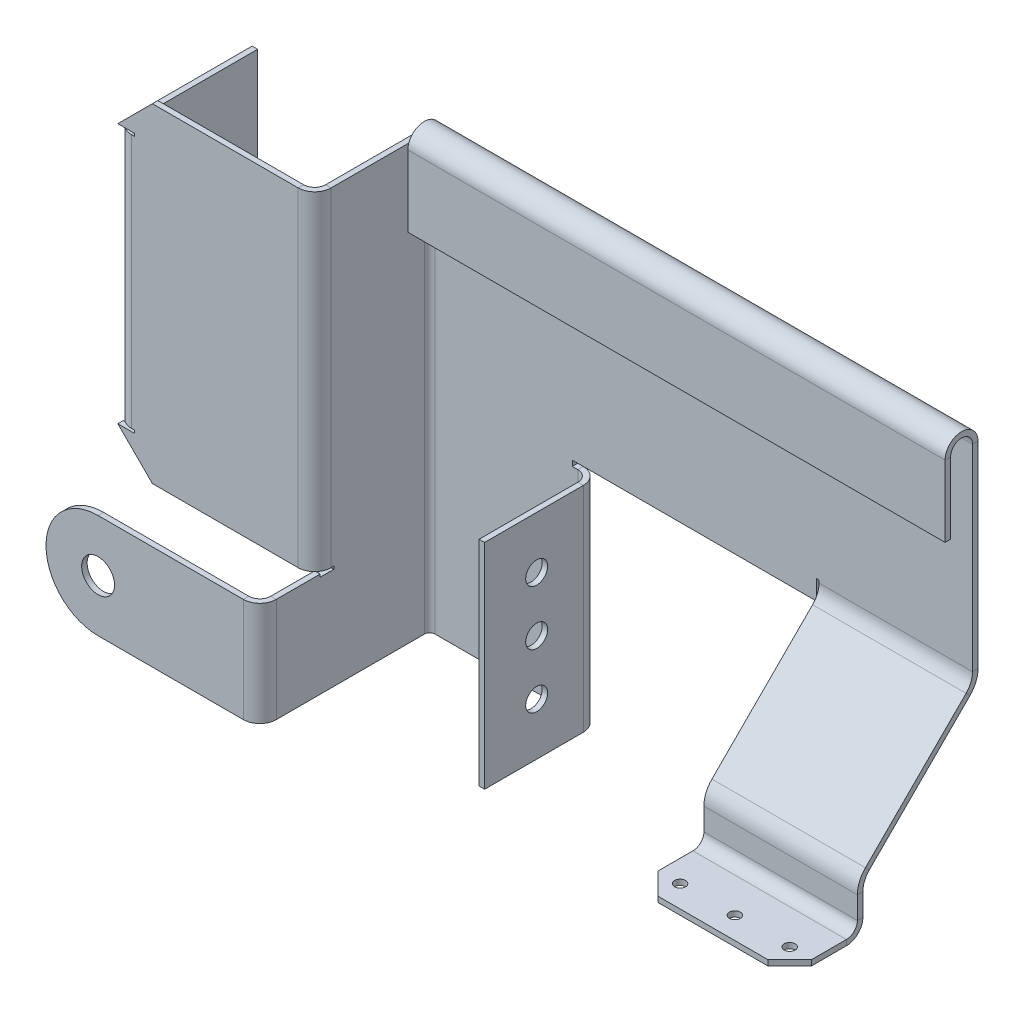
ISO-10303-21;
HEADER;
FILE_DESCRIPTION(('STEP AP214'),'2;1');
FILE_NAME('part.step','',(''),(''),'','','');
FILE_SCHEMA(('AUTOMOTIVE_DESIGN { 1 0 10303 214 1 1 1 1 }'));
ENDSEC;
DATA;
#1=APPLICATION_CONTEXT('core data for automotive mechanical design processes');
#2=APPLICATION_PROTOCOL_DEFINITION('international standard','automotive_design',2000,#1);
#3=PRODUCT_CONTEXT('',#1,'mechanical');
#4=PRODUCT('Part','Part','',(#3));
#5=PRODUCT_RELATED_PRODUCT_CATEGORY('part','',(#4));
#6=PRODUCT_DEFINITION_FORMATION('','',#4);
#7=PRODUCT_DEFINITION_CONTEXT('part definition',#1,'design');
#8=PRODUCT_DEFINITION('design','',#6,#7);
#9=PRODUCT_DEFINITION_SHAPE('','',#8);
#10=(LENGTH_UNIT() NAMED_UNIT(*) SI_UNIT(.MILLI.,.METRE.));
#11=(NAMED_UNIT(*) PLANE_ANGLE_UNIT() SI_UNIT($,.RADIAN.));
#12=(NAMED_UNIT(*) SI_UNIT($,.STERADIAN.) SOLID_ANGLE_UNIT());
#13=UNCERTAINTY_MEASURE_WITH_UNIT(LENGTH_MEASURE(1.E-05),#10,'distance_accuracy_value','');
#14=(GEOMETRIC_REPRESENTATION_CONTEXT(3) GLOBAL_UNCERTAINTY_ASSIGNED_CONTEXT((#13)) GLOBAL_UNIT_ASSIGNED_CONTEXT((#10,
#11,#12)) REPRESENTATION_CONTEXT('',''));
#15=CARTESIAN_POINT('',(0.,0.,0.));
#16=DIRECTION('',(0.,0.,1.));
#17=DIRECTION('',(1.,0.,0.));
#18=AXIS2_PLACEMENT_3D('',#15,#16,#17);
#19=CARTESIAN_POINT('',(0.,0.,2.5));
#20=DIRECTION('',(0.,1.,0.));
#21=DIRECTION('',(0.,0.,1.));
#22=AXIS2_PLACEMENT_3D('',#19,#20,#21);
#23=PLANE('',#22);
#24=DIRECTION('',(0.,0.,-1.));
#25=VECTOR('',#24,1.);
#26=CARTESIAN_POINT('',(-7.49999999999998,0.,2.5));
#27=LINE('',#26,#25);
#28=CARTESIAN_POINT('',(-7.49999999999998,0.,2.5));
#29=VERTEX_POINT('',#28);
#30=CARTESIAN_POINT('',(-7.49999999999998,0.,0.));
#31=VERTEX_POINT('',#30);
#32=EDGE_CURVE('E772',#29,#31,#27,.T.);
#33=ORIENTED_EDGE('',*,*,#32,.F.);
#34=DIRECTION('',(1.,0.,0.));
#35=VECTOR('',#34,1.);
#36=CARTESIAN_POINT('',(0.,0.,2.5));
#37=LINE('',#36,#35);
#38=CARTESIAN_POINT('',(-72.5,0.,2.5));
#39=VERTEX_POINT('',#38);
#40=EDGE_CURVE('E1073',#39,#29,#37,.T.);
#41=ORIENTED_EDGE('',*,*,#40,.F.);
#42=DIRECTION('',(0.,0.,-1.));
#43=VECTOR('',#42,1.);
#44=CARTESIAN_POINT('',(-72.5,0.,2.5));
#45=LINE('',#44,#43);
#46=CARTESIAN_POINT('',(-72.5,0.,0.));
#47=VERTEX_POINT('',#46);
#48=EDGE_CURVE('E1048',#39,#47,#45,.T.);
#49=ORIENTED_EDGE('',*,*,#48,.T.);
#50=DIRECTION('',(1.,0.,0.));
#51=VECTOR('',#50,1.);
#52=CARTESIAN_POINT('',(0.,0.,0.));
#53=LINE('',#52,#51);
#54=EDGE_CURVE('E1068',#47,#31,#53,.T.);
#55=ORIENTED_EDGE('',*,*,#54,.T.);
#56=EDGE_LOOP('',(#33,#41,#49,#55));
#57=FACE_BOUND('',#56,.T.);
#58=ADVANCED_FACE('F119',(#57),#23,.F.);
#59=CARTESIAN_POINT('',(0.,0.,2.5));
#60=DIRECTION('',(0.,0.,-1.));
#61=DIRECTION('',(-1.,0.,0.));
#62=AXIS2_PLACEMENT_3D('',#59,#60,#61);
#63=PLANE('',#62);
#64=DIRECTION('',(0.,1.,0.));
#65=VECTOR('',#64,1.);
#66=CARTESIAN_POINT('',(102.5,100.,2.5));
#67=LINE('',#66,#65);
#68=CARTESIAN_POINT('',(102.5,107.677669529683,2.5));
#69=VERTEX_POINT('',#68);
#70=CARTESIAN_POINT('',(102.5,108.927669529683,2.5));
#71=VERTEX_POINT('',#70);
#72=EDGE_CURVE('E654',#69,#71,#67,.T.);
#73=ORIENTED_EDGE('',*,*,#72,.F.);
#74=DIRECTION('',(-1.,0.,0.));
#75=VECTOR('',#74,1.);
#76=CARTESIAN_POINT('',(1085.00000000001,107.677669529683,2.49999999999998));
#77=LINE('',#76,#75);
#78=CARTESIAN_POINT('',(172.500000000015,107.677669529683,2.49999999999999));
#79=VERTEX_POINT('',#78);
#80=EDGE_CURVE('E527',#79,#69,#77,.T.);
#81=ORIENTED_EDGE('',*,*,#80,.F.);
#82=DIRECTION('',(0.,1.,0.));
#83=VECTOR('',#82,1.);
#84=CARTESIAN_POINT('',(172.5,197.5,2.5));
#85=LINE('',#84,#83);
#86=CARTESIAN_POINT('',(172.5,197.5,2.5));
#87=VERTEX_POINT('',#86);
#88=EDGE_CURVE('E1067',#79,#87,#85,.T.);
#89=ORIENTED_EDGE('',*,*,#88,.T.);
#90=DIRECTION('',(-1.,0.,0.));
#91=VECTOR('',#90,1.);
#92=CARTESIAN_POINT('',(-77.5,197.5,2.5));
#93=LINE('',#92,#91);
#94=CARTESIAN_POINT('',(-72.5,197.5,2.5));
#95=VERTEX_POINT('',#94);
#96=EDGE_CURVE('E1070',#87,#95,#93,.T.);
#97=ORIENTED_EDGE('',*,*,#96,.T.);
#98=DIRECTION('',(0.,-1.,0.));
#99=VECTOR('',#98,1.);
#100=CARTESIAN_POINT('',(-72.5,0.,2.5));
#101=LINE('',#100,#99);
#102=EDGE_CURVE('E1054',#39,#95,#101,.F.);
#103=ORIENTED_EDGE('',*,*,#102,.F.);
#104=ORIENTED_EDGE('',*,*,#40,.T.);
#105=DIRECTION('',(0.,1.,0.));
#106=VECTOR('',#105,1.);
#107=CARTESIAN_POINT('',(-7.49999999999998,97.5,2.5));
#108=LINE('',#107,#106);
#109=CARTESIAN_POINT('',(-7.49999999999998,97.5,2.5));
#110=VERTEX_POINT('',#109);
#111=EDGE_CURVE('E768',#110,#29,#108,.F.);
#112=ORIENTED_EDGE('',*,*,#111,.F.);
#113=DIRECTION('',(1.,0.,0.));
#114=VECTOR('',#113,1.);
#115=CARTESIAN_POINT('',(-9.99999999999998,97.5,2.5));
#116=LINE('',#115,#114);
#117=CARTESIAN_POINT('',(-9.99999999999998,97.5,2.5));
#118=VERTEX_POINT('',#117);
#119=EDGE_CURVE('E783',#118,#110,#116,.T.);
#120=ORIENTED_EDGE('',*,*,#119,.F.);
#121=DIRECTION('',(0.,-1.,0.));
#122=VECTOR('',#121,1.);
#123=CARTESIAN_POINT('',(-9.99999999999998,100.,2.5));
#124=LINE('',#123,#122);
#125=CARTESIAN_POINT('',(-9.99999999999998,100.,2.5));
#126=VERTEX_POINT('',#125);
#127=EDGE_CURVE('E778',#126,#118,#124,.T.);
#128=ORIENTED_EDGE('',*,*,#127,.F.);
#129=DIRECTION('',(1.,0.,0.));
#130=VECTOR('',#129,1.);
#131=CARTESIAN_POINT('',(172.5,100.,2.5));
#132=LINE('',#131,#130);
#133=CARTESIAN_POINT('',(101.25,100.,2.5));
#134=VERTEX_POINT('',#133);
#135=EDGE_CURVE('E1064',#126,#134,#132,.T.);
#136=ORIENTED_EDGE('',*,*,#135,.T.);
#137=DIRECTION('',(0.,-1.,0.));
#138=VECTOR('',#137,1.);
#139=CARTESIAN_POINT('',(101.25,108.927669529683,2.5));
#140=LINE('',#139,#138);
#141=CARTESIAN_POINT('',(101.25,108.927669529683,2.5));
#142=VERTEX_POINT('',#141);
#143=EDGE_CURVE('E660',#142,#134,#140,.T.);
#144=ORIENTED_EDGE('',*,*,#143,.F.);
#145=DIRECTION('',(-1.,0.,0.));
#146=VECTOR('',#145,1.);
#147=CARTESIAN_POINT('',(102.5,108.927669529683,2.5));
#148=LINE('',#147,#146);
#149=EDGE_CURVE('E668',#71,#142,#148,.T.);
#150=ORIENTED_EDGE('',*,*,#149,.F.);
#151=EDGE_LOOP('',(#73,#81,#89,#97,#103,#104,#112,#120,#128,#136,#144,#150));
#152=FACE_BOUND('',#151,.T.);
#153=ADVANCED_FACE('F1182',(#152),#63,.F.);
#154=CARTESIAN_POINT('',(0.,0.,0.));
#155=DIRECTION('',(0.,0.,-1.));
#156=DIRECTION('',(-1.,0.,0.));
#157=AXIS2_PLACEMENT_3D('',#154,#155,#156);
#158=PLANE('',#157);
#159=DIRECTION('',(-1.,0.,0.));
#160=VECTOR('',#159,1.);
#161=CARTESIAN_POINT('',(1085.00000000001,107.677669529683,0.));
#162=LINE('',#161,#160);
#163=CARTESIAN_POINT('',(172.500000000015,107.677669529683,0.));
#164=VERTEX_POINT('',#163);
#165=CARTESIAN_POINT('',(102.5,107.677669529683,0.));
#166=VERTEX_POINT('',#165);
#167=EDGE_CURVE('E1757',#164,#166,#162,.T.);
#168=ORIENTED_EDGE('',*,*,#167,.T.);
#169=DIRECTION('',(0.,1.,0.));
#170=VECTOR('',#169,1.);
#171=CARTESIAN_POINT('',(102.5,100.,0.));
#172=LINE('',#171,#170);
#173=CARTESIAN_POINT('',(102.5,108.927669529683,0.));
#174=VERTEX_POINT('',#173);
#175=EDGE_CURVE('E656',#166,#174,#172,.T.);
#176=ORIENTED_EDGE('',*,*,#175,.T.);
#177=DIRECTION('',(-1.,0.,0.));
#178=VECTOR('',#177,1.);
#179=CARTESIAN_POINT('',(102.5,108.927669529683,0.));
#180=LINE('',#179,#178);
#181=CARTESIAN_POINT('',(101.25,108.927669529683,0.));
#182=VERTEX_POINT('',#181);
#183=EDGE_CURVE('E659',#174,#182,#180,.T.);
#184=ORIENTED_EDGE('',*,*,#183,.T.);
#185=DIRECTION('',(0.,-1.,0.));
#186=VECTOR('',#185,1.);
#187=CARTESIAN_POINT('',(101.25,108.927669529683,0.));
#188=LINE('',#187,#186);
#189=CARTESIAN_POINT('',(101.25,100.,0.));
#190=VERTEX_POINT('',#189);
#191=EDGE_CURVE('E663',#182,#190,#188,.T.);
#192=ORIENTED_EDGE('',*,*,#191,.T.);
#193=DIRECTION('',(1.,0.,0.));
#194=VECTOR('',#193,1.);
#195=CARTESIAN_POINT('',(172.5,100.,0.));
#196=LINE('',#195,#194);
#197=CARTESIAN_POINT('',(-9.99999999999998,100.,0.));
#198=VERTEX_POINT('',#197);
#199=EDGE_CURVE('E1061',#198,#190,#196,.T.);
#200=ORIENTED_EDGE('',*,*,#199,.F.);
#201=DIRECTION('',(0.,-1.,0.));
#202=VECTOR('',#201,1.);
#203=CARTESIAN_POINT('',(-9.99999999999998,0.,0.));
#204=LINE('',#203,#202);
#205=CARTESIAN_POINT('',(-9.99999999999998,97.5,0.));
#206=VERTEX_POINT('',#205);
#207=EDGE_CURVE('E1122',#198,#206,#204,.T.);
#208=ORIENTED_EDGE('',*,*,#207,.T.);
#209=DIRECTION('',(1.,0.,0.));
#210=VECTOR('',#209,1.);
#211=CARTESIAN_POINT('',(0.,97.5,0.));
#212=LINE('',#211,#210);
#213=CARTESIAN_POINT('',(-7.49999999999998,97.5,0.));
#214=VERTEX_POINT('',#213);
#215=EDGE_CURVE('E1119',#206,#214,#212,.T.);
#216=ORIENTED_EDGE('',*,*,#215,.T.);
#217=DIRECTION('',(0.,1.,0.));
#218=VECTOR('',#217,1.);
#219=CARTESIAN_POINT('',(-7.49999999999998,97.5,0.));
#220=LINE('',#219,#218);
#221=EDGE_CURVE('E755',#214,#31,#220,.F.);
#222=ORIENTED_EDGE('',*,*,#221,.T.);
#223=ORIENTED_EDGE('',*,*,#54,.F.);
#224=DIRECTION('',(0.,-1.,0.));
#225=VECTOR('',#224,1.);
#226=CARTESIAN_POINT('',(-72.5,0.,0.));
#227=LINE('',#226,#225);
#228=CARTESIAN_POINT('',(-72.5,197.5,0.));
#229=VERTEX_POINT('',#228);
#230=EDGE_CURVE('E1042',#47,#229,#227,.F.);
#231=ORIENTED_EDGE('',*,*,#230,.T.);
#232=DIRECTION('',(-1.,0.,0.));
#233=VECTOR('',#232,1.);
#234=CARTESIAN_POINT('',(-77.5,197.5,0.));
#235=LINE('',#234,#233);
#236=CARTESIAN_POINT('',(172.5,197.5,0.));
#237=VERTEX_POINT('',#236);
#238=EDGE_CURVE('E1081',#237,#229,#235,.T.);
#239=ORIENTED_EDGE('',*,*,#238,.F.);
#240=DIRECTION('',(0.,1.,0.));
#241=VECTOR('',#240,1.);
#242=CARTESIAN_POINT('',(172.5,197.5,0.));
#243=LINE('',#242,#241);
#244=EDGE_CURVE('E1079',#164,#237,#243,.T.);
#245=ORIENTED_EDGE('',*,*,#244,.F.);
#246=EDGE_LOOP('',(#168,#176,#184,#192,#200,#208,#216,#222,#223,#231,#239,#245));
#247=FACE_BOUND('',#246,.T.);
#248=ADVANCED_FACE('F1188',(#247),#158,.T.);
#249=CARTESIAN_POINT('',(-148.75,23.75,77.5));
#250=DIRECTION('',(0.,0.,-1.));
#251=DIRECTION('',(-1.,0.,0.));
#252=AXIS2_PLACEMENT_3D('',#249,#250,#251);
#253=CYLINDRICAL_SURFACE('',#252,23.75);
#254=DIRECTION('',(0.,0.,-1.));
#255=VECTOR('',#254,1.);
#256=CARTESIAN_POINT('',(-148.75,47.5,80.));
#257=LINE('',#256,#255);
#258=CARTESIAN_POINT('',(-148.75,47.5,77.5));
#259=VERTEX_POINT('',#258);
#260=CARTESIAN_POINT('',(-148.75,47.5,80.));
#261=VERTEX_POINT('',#260);
#262=EDGE_CURVE('E1109',#259,#261,#257,.F.);
#263=ORIENTED_EDGE('',*,*,#262,.F.);
#264=CARTESIAN_POINT('',(-148.75,23.75,77.5));
#265=DIRECTION('',(0.,0.,-1.));
#266=DIRECTION('',(-1.,0.,0.));
#267=AXIS2_PLACEMENT_3D('',#264,#265,#266);
#268=CIRCLE('',#267,23.75);
#269=CARTESIAN_POINT('',(-148.75,0.,77.5));
#270=VERTEX_POINT('',#269);
#271=EDGE_CURVE('E1115',#270,#259,#268,.T.);
#272=ORIENTED_EDGE('',*,*,#271,.F.);
#273=DIRECTION('',(0.,0.,-1.));
#274=VECTOR('',#273,1.);
#275=CARTESIAN_POINT('',(-148.75,0.,80.));
#276=LINE('',#275,#274);
#277=CARTESIAN_POINT('',(-148.75,0.,80.));
#278=VERTEX_POINT('',#277);
#279=EDGE_CURVE('E1112',#278,#270,#276,.T.);
#280=ORIENTED_EDGE('',*,*,#279,.F.);
#281=CARTESIAN_POINT('',(-148.75,23.75,80.));
#282=DIRECTION('',(0.,0.,-1.));
#283=DIRECTION('',(-1.,0.,0.));
#284=AXIS2_PLACEMENT_3D('',#281,#282,#283);
#285=CIRCLE('',#284,23.75);
#286=EDGE_CURVE('E1117',#261,#278,#285,.F.);
#287=ORIENTED_EDGE('',*,*,#286,.F.);
#288=EDGE_LOOP('',(#263,#272,#280,#287));
#289=FACE_BOUND('',#288,.T.);
#290=ADVANCED_FACE('F1215',(#289),#253,.T.);
#291=CARTESIAN_POINT('',(0.,0.,55.));
#292=DIRECTION('',(0.,0.,1.));
#293=DIRECTION('',(1.,0.,0.));
#294=AXIS2_PLACEMENT_3D('',#291,#292,#293);
#295=PLANE('',#294);
#296=DIRECTION('',(0.707106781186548,0.707106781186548,0.));
#297=VECTOR('',#296,1.);
#298=CARTESIAN_POINT('',(-173.25,173.25,55.));
#299=LINE('',#298,#297);
#300=CARTESIAN_POINT('',(-149.,197.5,55.));
#301=VERTEX_POINT('',#300);
#302=CARTESIAN_POINT('',(-164.75,181.75,55.));
#303=VERTEX_POINT('',#302);
#304=EDGE_CURVE('E1106',#301,#303,#299,.F.);
#305=ORIENTED_EDGE('',*,*,#304,.T.);
#306=DIRECTION('',(1.,0.,0.));
#307=VECTOR('',#306,1.);
#308=CARTESIAN_POINT('',(0.,181.75,55.));
#309=LINE('',#308,#307);
#310=CARTESIAN_POINT('',(-157.25,181.75,55.));
#311=VERTEX_POINT('',#310);
#312=EDGE_CURVE('E852',#303,#311,#309,.T.);
#313=ORIENTED_EDGE('',*,*,#312,.T.);
#314=DIRECTION('',(0.,-1.,0.));
#315=VECTOR('',#314,1.);
#316=CARTESIAN_POINT('',(-157.25,0.,55.));
#317=LINE('',#316,#315);
#318=CARTESIAN_POINT('',(-157.25,180.5,55.));
#319=VERTEX_POINT('',#318);
#320=EDGE_CURVE('E897',#311,#319,#317,.T.);
#321=ORIENTED_EDGE('',*,*,#320,.T.);
#322=DIRECTION('',(-1.,0.,0.));
#323=VECTOR('',#322,1.);
#324=CARTESIAN_POINT('',(0.,180.5,55.));
#325=LINE('',#324,#323);
#326=CARTESIAN_POINT('',(-158.5,180.5,55.));
#327=VERTEX_POINT('',#326);
#328=EDGE_CURVE('E894',#319,#327,#325,.T.);
#329=ORIENTED_EDGE('',*,*,#328,.T.);
#330=DIRECTION('',(0.,1.,0.));
#331=VECTOR('',#330,1.);
#332=CARTESIAN_POINT('',(-158.5,180.5,55.));
#333=LINE('',#332,#331);
#334=CARTESIAN_POINT('',(-158.5,64.5,55.));
#335=VERTEX_POINT('',#334);
#336=EDGE_CURVE('E826',#327,#335,#333,.F.);
#337=ORIENTED_EDGE('',*,*,#336,.T.);
#338=DIRECTION('',(1.,0.,0.));
#339=VECTOR('',#338,1.);
#340=CARTESIAN_POINT('',(0.,64.5,55.));
#341=LINE('',#340,#339);
#342=CARTESIAN_POINT('',(-157.25,64.5,55.));
#343=VERTEX_POINT('',#342);
#344=EDGE_CURVE('E891',#335,#343,#341,.T.);
#345=ORIENTED_EDGE('',*,*,#344,.T.);
#346=DIRECTION('',(0.,-1.,0.));
#347=VECTOR('',#346,1.);
#348=CARTESIAN_POINT('',(-157.25,0.,55.));
#349=LINE('',#348,#347);
#350=CARTESIAN_POINT('',(-157.25,63.25,55.));
#351=VERTEX_POINT('',#350);
#352=EDGE_CURVE('E888',#343,#351,#349,.T.);
#353=ORIENTED_EDGE('',*,*,#352,.T.);
#354=DIRECTION('',(-1.,0.,0.));
#355=VECTOR('',#354,1.);
#356=CARTESIAN_POINT('',(0.,63.25,55.));
#357=LINE('',#356,#355);
#358=CARTESIAN_POINT('',(-164.75,63.25,55.));
#359=VERTEX_POINT('',#358);
#360=EDGE_CURVE('E885',#351,#359,#357,.T.);
#361=ORIENTED_EDGE('',*,*,#360,.T.);
#362=DIRECTION('',(-0.707106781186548,0.707106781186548,0.));
#363=VECTOR('',#362,1.);
#364=CARTESIAN_POINT('',(-50.7500000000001,-50.7500000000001,55.));
#365=LINE('',#364,#363);
#366=CARTESIAN_POINT('',(-149.,47.5,55.));
#367=VERTEX_POINT('',#366);
#368=EDGE_CURVE('E1100',#359,#367,#365,.F.);
#369=ORIENTED_EDGE('',*,*,#368,.T.);
#370=DIRECTION('',(-1.,0.,0.));
#371=VECTOR('',#370,1.);
#372=CARTESIAN_POINT('',(-166.,47.5,55.));
#373=LINE('',#372,#371);
#374=CARTESIAN_POINT('',(-82.5000000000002,47.5,55.));
#375=VERTEX_POINT('',#374);
#376=EDGE_CURVE('E913',#375,#367,#373,.T.);
#377=ORIENTED_EDGE('',*,*,#376,.F.);
#378=DIRECTION('',(0.,1.,0.));
#379=VECTOR('',#378,1.);
#380=CARTESIAN_POINT('',(-82.5000000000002,0.,55.));
#381=LINE('',#380,#379);
#382=CARTESIAN_POINT('',(-82.5000000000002,197.5,55.));
#383=VERTEX_POINT('',#382);
#384=EDGE_CURVE('E907',#375,#383,#381,.T.);
#385=ORIENTED_EDGE('',*,*,#384,.T.);
#386=DIRECTION('',(1.,0.,0.));
#387=VECTOR('',#386,1.);
#388=CARTESIAN_POINT('',(-77.5000000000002,197.5,55.));
#389=LINE('',#388,#387);
#390=EDGE_CURVE('E916',#301,#383,#389,.T.);
#391=ORIENTED_EDGE('',*,*,#390,.F.);
#392=EDGE_LOOP('',(#305,#313,#321,#329,#337,#345,#353,#361,#369,#377,#385,#391));
#393=FACE_BOUND('',#392,.T.);
#394=ADVANCED_FACE('F1219',(#393),#295,.T.);
#395=CARTESIAN_POINT('',(0.,0.,52.5));
#396=DIRECTION('',(0.,0.,1.));
#397=DIRECTION('',(1.,0.,0.));
#398=AXIS2_PLACEMENT_3D('',#395,#396,#397);
#399=PLANE('',#398);
#400=DIRECTION('',(1.,0.,0.));
#401=VECTOR('',#400,1.);
#402=CARTESIAN_POINT('',(-164.75,181.75,52.5));
#403=LINE('',#402,#401);
#404=CARTESIAN_POINT('',(-164.75,181.75,52.5));
#405=VERTEX_POINT('',#404);
#406=CARTESIAN_POINT('',(-157.25,181.75,52.5));
#407=VERTEX_POINT('',#406);
#408=EDGE_CURVE('E849',#405,#407,#403,.T.);
#409=ORIENTED_EDGE('',*,*,#408,.F.);
#410=DIRECTION('',(-0.707106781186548,-0.707106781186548,0.));
#411=VECTOR('',#410,1.);
#412=CARTESIAN_POINT('',(-166.,180.5,52.5));
#413=LINE('',#412,#411);
#414=CARTESIAN_POINT('',(-149.,197.5,52.5));
#415=VERTEX_POINT('',#414);
#416=EDGE_CURVE('E1102',#405,#415,#413,.F.);
#417=ORIENTED_EDGE('',*,*,#416,.T.);
#418=DIRECTION('',(1.,0.,0.));
#419=VECTOR('',#418,1.);
#420=CARTESIAN_POINT('',(-77.5000000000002,197.5,52.5));
#421=LINE('',#420,#419);
#422=CARTESIAN_POINT('',(-82.5000000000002,197.5,52.5));
#423=VERTEX_POINT('',#422);
#424=EDGE_CURVE('E917',#415,#423,#421,.T.);
#425=ORIENTED_EDGE('',*,*,#424,.T.);
#426=DIRECTION('',(0.,1.,0.));
#427=VECTOR('',#426,1.);
#428=CARTESIAN_POINT('',(-82.5000000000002,47.5,52.5));
#429=LINE('',#428,#427);
#430=CARTESIAN_POINT('',(-82.5000000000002,47.5,52.5));
#431=VERTEX_POINT('',#430);
#432=EDGE_CURVE('E901',#431,#423,#429,.T.);
#433=ORIENTED_EDGE('',*,*,#432,.F.);
#434=DIRECTION('',(-1.,0.,0.));
#435=VECTOR('',#434,1.);
#436=CARTESIAN_POINT('',(-166.,47.5,52.5));
#437=LINE('',#436,#435);
#438=CARTESIAN_POINT('',(-149.,47.5,52.5));
#439=VERTEX_POINT('',#438);
#440=EDGE_CURVE('E912',#431,#439,#437,.T.);
#441=ORIENTED_EDGE('',*,*,#440,.T.);
#442=DIRECTION('',(0.707106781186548,-0.707106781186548,0.));
#443=VECTOR('',#442,1.);
#444=CARTESIAN_POINT('',(-149.,47.5,52.5));
#445=LINE('',#444,#443);
#446=CARTESIAN_POINT('',(-164.75,63.25,52.5));
#447=VERTEX_POINT('',#446);
#448=EDGE_CURVE('E1097',#439,#447,#445,.F.);
#449=ORIENTED_EDGE('',*,*,#448,.T.);
#450=DIRECTION('',(-1.,0.,0.));
#451=VECTOR('',#450,1.);
#452=CARTESIAN_POINT('',(-157.25,63.25,52.5));
#453=LINE('',#452,#451);
#454=CARTESIAN_POINT('',(-157.25,63.25,52.5));
#455=VERTEX_POINT('',#454);
#456=EDGE_CURVE('E869',#455,#447,#453,.T.);
#457=ORIENTED_EDGE('',*,*,#456,.F.);
#458=DIRECTION('',(0.,-1.,0.));
#459=VECTOR('',#458,1.);
#460=CARTESIAN_POINT('',(-157.25,64.5,52.5));
#461=LINE('',#460,#459);
#462=CARTESIAN_POINT('',(-157.25,64.5,52.5));
#463=VERTEX_POINT('',#462);
#464=EDGE_CURVE('E865',#463,#455,#461,.T.);
#465=ORIENTED_EDGE('',*,*,#464,.F.);
#466=DIRECTION('',(1.,0.,0.));
#467=VECTOR('',#466,1.);
#468=CARTESIAN_POINT('',(-158.5,64.5,52.5));
#469=LINE('',#468,#467);
#470=CARTESIAN_POINT('',(-158.5,64.5,52.5));
#471=VERTEX_POINT('',#470);
#472=EDGE_CURVE('E862',#471,#463,#469,.T.);
#473=ORIENTED_EDGE('',*,*,#472,.F.);
#474=DIRECTION('',(0.,1.,0.));
#475=VECTOR('',#474,1.);
#476=CARTESIAN_POINT('',(-158.5,180.5,52.5));
#477=LINE('',#476,#475);
#478=CARTESIAN_POINT('',(-158.5,180.5,52.5));
#479=VERTEX_POINT('',#478);
#480=EDGE_CURVE('E839',#479,#471,#477,.F.);
#481=ORIENTED_EDGE('',*,*,#480,.F.);
#482=DIRECTION('',(-1.,0.,0.));
#483=VECTOR('',#482,1.);
#484=CARTESIAN_POINT('',(-157.25,180.5,52.5));
#485=LINE('',#484,#483);
#486=CARTESIAN_POINT('',(-157.25,180.5,52.5));
#487=VERTEX_POINT('',#486);
#488=EDGE_CURVE('E858',#487,#479,#485,.T.);
#489=ORIENTED_EDGE('',*,*,#488,.F.);
#490=DIRECTION('',(0.,-1.,0.));
#491=VECTOR('',#490,1.);
#492=CARTESIAN_POINT('',(-157.25,181.75,52.5));
#493=LINE('',#492,#491);
#494=EDGE_CURVE('E854',#407,#487,#493,.T.);
#495=ORIENTED_EDGE('',*,*,#494,.F.);
#496=EDGE_LOOP('',(#409,#417,#425,#433,#441,#449,#457,#465,#473,#481,#489,#495));
#497=FACE_BOUND('',#496,.T.);
#498=ADVANCED_FACE('F1208',(#497),#399,.F.);
#499=CARTESIAN_POINT('',(-149.,47.5,55.));
#500=DIRECTION('',(0.707106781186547,0.707106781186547,0.));
#501=DIRECTION('',(0.,0.,-1.));
#502=AXIS2_PLACEMENT_3D('',#499,#500,#501);
#503=PLANE('',#502);
#504=ORIENTED_EDGE('',*,*,#368,.F.);
#505=DIRECTION('',(0.,0.,1.));
#506=VECTOR('',#505,1.);
#507=CARTESIAN_POINT('',(-164.75,63.25,52.5));
#508=LINE('',#507,#506);
#509=EDGE_CURVE('E871',#447,#359,#508,.T.);
#510=ORIENTED_EDGE('',*,*,#509,.F.);
#511=ORIENTED_EDGE('',*,*,#448,.F.);
#512=DIRECTION('',(0.,0.,-1.));
#513=VECTOR('',#512,1.);
#514=CARTESIAN_POINT('',(-149.,47.5,55.));
#515=LINE('',#514,#513);
#516=EDGE_CURVE('E1094',#367,#439,#515,.T.);
#517=ORIENTED_EDGE('',*,*,#516,.F.);
#518=EDGE_LOOP('',(#504,#510,#511,#517));
#519=FACE_BOUND('',#518,.T.);
#520=ADVANCED_FACE('F1204',(#519),#503,.F.);
#521=CARTESIAN_POINT('',(-166.,180.5,55.));
#522=DIRECTION('',(0.707106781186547,-0.707106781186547,0.));
#523=DIRECTION('',(0.,0.,-1.));
#524=AXIS2_PLACEMENT_3D('',#521,#522,#523);
#525=PLANE('',#524);
#526=ORIENTED_EDGE('',*,*,#416,.F.);
#527=DIRECTION('',(0.,0.,1.));
#528=VECTOR('',#527,1.);
#529=CARTESIAN_POINT('',(-164.75,181.75,52.5));
#530=LINE('',#529,#528);
#531=EDGE_CURVE('E853',#405,#303,#530,.T.);
#532=ORIENTED_EDGE('',*,*,#531,.T.);
#533=ORIENTED_EDGE('',*,*,#304,.F.);
#534=DIRECTION('',(0.,0.,1.));
#535=VECTOR('',#534,1.);
#536=CARTESIAN_POINT('',(-149.,197.5,55.));
#537=LINE('',#536,#535);
#538=EDGE_CURVE('E1104',#415,#301,#537,.T.);
#539=ORIENTED_EDGE('',*,*,#538,.F.);
#540=EDGE_LOOP('',(#526,#532,#533,#539));
#541=FACE_BOUND('',#540,.T.);
#542=ADVANCED_FACE('F1207',(#541),#525,.F.);
#543=CARTESIAN_POINT('',(-77.5,197.5,2.49999999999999));
#544=DIRECTION('',(0.,-1.,0.));
#545=DIRECTION('',(0.,0.,-1.));
#546=AXIS2_PLACEMENT_3D('',#543,#544,#545);
#547=PLANE('',#546);
#548=DIRECTION('',(1.,0.,0.));
#549=VECTOR('',#548,1.);
#550=CARTESIAN_POINT('',(-77.5000000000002,197.5,47.5));
#551=LINE('',#550,#549);
#552=CARTESIAN_POINT('',(-77.5000000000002,197.5,47.5));
#553=VERTEX_POINT('',#552);
#554=CARTESIAN_POINT('',(-75.0000000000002,197.5,47.5));
#555=VERTEX_POINT('',#554);
#556=EDGE_CURVE('E930',#553,#555,#551,.T.);
#557=ORIENTED_EDGE('',*,*,#556,.T.);
#558=DIRECTION('',(0.,0.,1.));
#559=VECTOR('',#558,1.);
#560=CARTESIAN_POINT('',(-75.,197.5,2.5));
#561=LINE('',#560,#559);
#562=CARTESIAN_POINT('',(-75.,197.5,4.99999999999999));
#563=VERTEX_POINT('',#562);
#564=EDGE_CURVE('E1030',#555,#563,#561,.F.);
#565=ORIENTED_EDGE('',*,*,#564,.T.);
#566=DIRECTION('',(1.,0.,0.));
#567=VECTOR('',#566,1.);
#568=CARTESIAN_POINT('',(-77.5,197.5,4.99999999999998));
#569=LINE('',#568,#567);
#570=CARTESIAN_POINT('',(-77.5,197.5,4.99999999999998));
#571=VERTEX_POINT('',#570);
#572=EDGE_CURVE('E1020',#563,#571,#569,.F.);
#573=ORIENTED_EDGE('',*,*,#572,.T.);
#574=DIRECTION('',(0.,0.,-1.));
#575=VECTOR('',#574,1.);
#576=CARTESIAN_POINT('',(-77.5,197.5,-2.88366127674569E-13));
#577=LINE('',#576,#575);
#578=EDGE_CURVE('E1025',#553,#571,#577,.T.);
#579=ORIENTED_EDGE('',*,*,#578,.F.);
#580=EDGE_LOOP('',(#557,#565,#573,#579));
#581=FACE_BOUND('',#580,.T.);
#582=ADVANCED_FACE('F1212',(#581),#547,.F.);
#583=CARTESIAN_POINT('',(-77.5,0.,-2.88366127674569E-13));
#584=DIRECTION('',(1.,0.,0.));
#585=DIRECTION('',(0.,0.,-1.));
#586=AXIS2_PLACEMENT_3D('',#583,#584,#585);
#587=PLANE('',#586);
#588=DIRECTION('',(0.,1.,0.));
#589=VECTOR('',#588,1.);
#590=CARTESIAN_POINT('',(-77.5000000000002,197.5,47.5));
#591=LINE('',#590,#589);
#592=CARTESIAN_POINT('',(-77.5000000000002,47.5,47.5));
#593=VERTEX_POINT('',#592);
#594=EDGE_CURVE('E936',#553,#593,#591,.F.);
#595=ORIENTED_EDGE('',*,*,#594,.F.);
#596=ORIENTED_EDGE('',*,*,#578,.T.);
#597=DIRECTION('',(0.,-1.,0.));
#598=VECTOR('',#597,1.);
#599=CARTESIAN_POINT('',(-77.5,197.5,4.99999999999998));
#600=LINE('',#599,#598);
#601=CARTESIAN_POINT('',(-77.5,0.,4.99999999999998));
#602=VERTEX_POINT('',#601);
#603=EDGE_CURVE('E1032',#602,#571,#600,.F.);
#604=ORIENTED_EDGE('',*,*,#603,.F.);
#605=DIRECTION('',(0.,0.,1.));
#606=VECTOR('',#605,1.);
#607=CARTESIAN_POINT('',(-77.5,0.,-2.88366127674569E-13));
#608=LINE('',#607,#606);
#609=CARTESIAN_POINT('',(-77.5000000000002,0.,72.5));
#610=VERTEX_POINT('',#609);
#611=EDGE_CURVE('E1021',#602,#610,#608,.T.);
#612=ORIENTED_EDGE('',*,*,#611,.T.);
#613=DIRECTION('',(0.,1.,0.));
#614=VECTOR('',#613,1.);
#615=CARTESIAN_POINT('',(-77.5000000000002,47.5,72.5));
#616=LINE('',#615,#614);
#617=CARTESIAN_POINT('',(-77.5000000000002,47.5,72.5));
#618=VERTEX_POINT('',#617);
#619=EDGE_CURVE('E1004',#618,#610,#616,.F.);
#620=ORIENTED_EDGE('',*,*,#619,.F.);
#621=DIRECTION('',(0.,0.,-1.));
#622=VECTOR('',#621,1.);
#623=CARTESIAN_POINT('',(-77.5000000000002,47.5,72.5));
#624=LINE('',#623,#622);
#625=CARTESIAN_POINT('',(-77.5000000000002,47.5,52.5));
#626=VERTEX_POINT('',#625);
#627=EDGE_CURVE('E1018',#618,#626,#624,.T.);
#628=ORIENTED_EDGE('',*,*,#627,.T.);
#629=DIRECTION('',(0.,1.,0.));
#630=VECTOR('',#629,1.);
#631=CARTESIAN_POINT('',(-77.5000000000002,46.25,52.5));
#632=LINE('',#631,#630);
#633=CARTESIAN_POINT('',(-77.5000000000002,46.25,52.5));
#634=VERTEX_POINT('',#633);
#635=EDGE_CURVE('E958',#634,#626,#632,.T.);
#636=ORIENTED_EDGE('',*,*,#635,.F.);
#637=DIRECTION('',(0.,0.,1.));
#638=VECTOR('',#637,1.);
#639=CARTESIAN_POINT('',(-77.5000000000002,46.25,46.25));
#640=LINE('',#639,#638);
#641=CARTESIAN_POINT('',(-77.5000000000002,46.25,46.25));
#642=VERTEX_POINT('',#641);
#643=EDGE_CURVE('E954',#642,#634,#640,.T.);
#644=ORIENTED_EDGE('',*,*,#643,.F.);
#645=DIRECTION('',(0.,-1.,0.));
#646=VECTOR('',#645,1.);
#647=CARTESIAN_POINT('',(-77.5000000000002,47.5,46.25));
#648=LINE('',#647,#646);
#649=CARTESIAN_POINT('',(-77.5000000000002,47.5,46.25));
#650=VERTEX_POINT('',#649);
#651=EDGE_CURVE('E950',#650,#642,#648,.T.);
#652=ORIENTED_EDGE('',*,*,#651,.F.);
#653=DIRECTION('',(0.,0.,-1.));
#654=VECTOR('',#653,1.);
#655=CARTESIAN_POINT('',(-77.5000000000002,47.5,47.5));
#656=LINE('',#655,#654);
#657=EDGE_CURVE('E946',#593,#650,#656,.T.);
#658=ORIENTED_EDGE('',*,*,#657,.F.);
#659=EDGE_LOOP('',(#595,#596,#604,#612,#620,#628,#636,#644,#652,#658));
#660=FACE_BOUND('',#659,.T.);
#661=ADVANCED_FACE('F1253',(#660),#587,.F.);
#662=CARTESIAN_POINT('',(-75.,0.,-2.79637424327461E-13));
#663=DIRECTION('',(1.,0.,0.));
#664=DIRECTION('',(0.,0.,-1.));
#665=AXIS2_PLACEMENT_3D('',#662,#663,#664);
#666=PLANE('',#665);
#667=ORIENTED_EDGE('',*,*,#564,.F.);
#668=DIRECTION('',(0.,1.,0.));
#669=VECTOR('',#668,1.);
#670=CARTESIAN_POINT('',(-75.0000000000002,197.5,47.5));
#671=LINE('',#670,#669);
#672=CARTESIAN_POINT('',(-75.0000000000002,47.5,47.5));
#673=VERTEX_POINT('',#672);
#674=EDGE_CURVE('E923',#555,#673,#671,.F.);
#675=ORIENTED_EDGE('',*,*,#674,.T.);
#676=DIRECTION('',(0.,0.,-1.));
#677=VECTOR('',#676,1.);
#678=CARTESIAN_POINT('',(-75.,47.5,-2.79637424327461E-13));
#679=LINE('',#678,#677);
#680=CARTESIAN_POINT('',(-75.0000000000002,47.5,46.25));
#681=VERTEX_POINT('',#680);
#682=EDGE_CURVE('E1092',#673,#681,#679,.T.);
#683=ORIENTED_EDGE('',*,*,#682,.T.);
#684=DIRECTION('',(0.,-1.,0.));
#685=VECTOR('',#684,1.);
#686=CARTESIAN_POINT('',(-75.0000000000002,0.,46.25));
#687=LINE('',#686,#685);
#688=CARTESIAN_POINT('',(-75.0000000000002,46.25,46.25));
#689=VERTEX_POINT('',#688);
#690=EDGE_CURVE('E1090',#681,#689,#687,.T.);
#691=ORIENTED_EDGE('',*,*,#690,.T.);
#692=DIRECTION('',(0.,0.,1.));
#693=VECTOR('',#692,1.);
#694=CARTESIAN_POINT('',(-75.,46.25,-2.79637424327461E-13));
#695=LINE('',#694,#693);
#696=CARTESIAN_POINT('',(-75.0000000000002,46.25,52.5));
#697=VERTEX_POINT('',#696);
#698=EDGE_CURVE('E1088',#689,#697,#695,.T.);
#699=ORIENTED_EDGE('',*,*,#698,.T.);
#700=DIRECTION('',(0.,1.,0.));
#701=VECTOR('',#700,1.);
#702=CARTESIAN_POINT('',(-75.0000000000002,0.,52.5));
#703=LINE('',#702,#701);
#704=CARTESIAN_POINT('',(-75.0000000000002,47.5,52.5));
#705=VERTEX_POINT('',#704);
#706=EDGE_CURVE('E949',#697,#705,#703,.T.);
#707=ORIENTED_EDGE('',*,*,#706,.T.);
#708=DIRECTION('',(0.,0.,-1.));
#709=VECTOR('',#708,1.);
#710=CARTESIAN_POINT('',(-75.0000000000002,47.5,72.5));
#711=LINE('',#710,#709);
#712=CARTESIAN_POINT('',(-75.0000000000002,47.5,72.5));
#713=VERTEX_POINT('',#712);
#714=EDGE_CURVE('E1016',#713,#705,#711,.T.);
#715=ORIENTED_EDGE('',*,*,#714,.F.);
#716=DIRECTION('',(0.,1.,0.));
#717=VECTOR('',#716,1.);
#718=CARTESIAN_POINT('',(-75.0000000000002,47.5,72.5));
#719=LINE('',#718,#717);
#720=CARTESIAN_POINT('',(-75.0000000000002,0.,72.5));
#721=VERTEX_POINT('',#720);
#722=EDGE_CURVE('E991',#713,#721,#719,.F.);
#723=ORIENTED_EDGE('',*,*,#722,.T.);
#724=DIRECTION('',(0.,0.,-1.));
#725=VECTOR('',#724,1.);
#726=CARTESIAN_POINT('',(-75.0000000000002,0.,52.5));
#727=LINE('',#726,#725);
#728=CARTESIAN_POINT('',(-75.,0.,4.99999999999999));
#729=VERTEX_POINT('',#728);
#730=EDGE_CURVE('E1027',#729,#721,#727,.F.);
#731=ORIENTED_EDGE('',*,*,#730,.F.);
#732=DIRECTION('',(0.,-1.,0.));
#733=VECTOR('',#732,1.);
#734=CARTESIAN_POINT('',(-75.,197.5,4.99999999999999));
#735=LINE('',#734,#733);
#736=EDGE_CURVE('E1038',#563,#729,#735,.T.);
#737=ORIENTED_EDGE('',*,*,#736,.F.);
#738=EDGE_LOOP('',(#667,#675,#683,#691,#699,#707,#715,#723,#731,#737));
#739=FACE_BOUND('',#738,.T.);
#740=ADVANCED_FACE('F1202',(#739),#666,.T.);
#741=CARTESIAN_POINT('',(172.5,100.,2.5));
#742=DIRECTION('',(0.,1.,0.));
#743=DIRECTION('',(-1.,0.,0.));
#744=AXIS2_PLACEMENT_3D('',#741,#742,#743);
#745=PLANE('',#744);
#746=ORIENTED_EDGE('',*,*,#199,.T.);
#747=DIRECTION('',(0.,0.,1.));
#748=VECTOR('',#747,1.);
#749=CARTESIAN_POINT('',(101.25,100.,0.));
#750=LINE('',#749,#748);
#751=EDGE_CURVE('E666',#190,#134,#750,.T.);
#752=ORIENTED_EDGE('',*,*,#751,.T.);
#753=ORIENTED_EDGE('',*,*,#135,.F.);
#754=DIRECTION('',(0.,0.,-1.));
#755=VECTOR('',#754,1.);
#756=CARTESIAN_POINT('',(-9.99999999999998,100.,2.5));
#757=LINE('',#756,#755);
#758=EDGE_CURVE('E782',#126,#198,#757,.T.);
#759=ORIENTED_EDGE('',*,*,#758,.T.);
#760=EDGE_LOOP('',(#746,#752,#753,#759));
#761=FACE_BOUND('',#760,.T.);
#762=ADVANCED_FACE('F1198',(#761),#745,.F.);
#763=CARTESIAN_POINT('',(172.5,197.5,2.5));
#764=DIRECTION('',(-1.,0.,0.));
#765=DIRECTION('',(0.,0.,1.));
#766=AXIS2_PLACEMENT_3D('',#763,#764,#765);
#767=PLANE('',#766);
#768=ORIENTED_EDGE('',*,*,#88,.F.);
#769=DIRECTION('',(0.,0.,-1.));
#770=VECTOR('',#769,1.);
#771=CARTESIAN_POINT('',(172.500000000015,107.677669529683,0.));
#772=LINE('',#771,#770);
#773=EDGE_CURVE('E625',#164,#79,#772,.F.);
#774=ORIENTED_EDGE('',*,*,#773,.F.);
#775=ORIENTED_EDGE('',*,*,#244,.T.);
#776=DIRECTION('',(0.,0.,-1.));
#777=VECTOR('',#776,1.);
#778=CARTESIAN_POINT('',(172.5,197.5,2.5));
#779=LINE('',#778,#777);
#780=EDGE_CURVE('E1076',#87,#237,#779,.T.);
#781=ORIENTED_EDGE('',*,*,#780,.F.);
#782=EDGE_LOOP('',(#768,#774,#775,#781));
#783=FACE_BOUND('',#782,.T.);
#784=ADVANCED_FACE('F1194',(#783),#767,.F.);
#785=CARTESIAN_POINT('',(-72.5,197.5,5.));
#786=DIRECTION('',(0.,1.,0.));
#787=DIRECTION('',(0.,0.,1.));
#788=AXIS2_PLACEMENT_3D('',#785,#786,#787);
#789=PLANE('',#788);
#790=ORIENTED_EDGE('',*,*,#572,.F.);
#791=CARTESIAN_POINT('',(-72.5,197.5,5.));
#792=DIRECTION('',(0.,-1.,0.));
#793=DIRECTION('',(0.,0.,-1.));
#794=AXIS2_PLACEMENT_3D('',#791,#792,#793);
#795=CIRCLE('',#794,2.5);
#796=EDGE_CURVE('E1051',#95,#563,#795,.F.);
#797=ORIENTED_EDGE('',*,*,#796,.F.);
#798=DIRECTION('',(0.,0.,-1.));
#799=VECTOR('',#798,1.);
#800=CARTESIAN_POINT('',(-72.5,197.5,2.5));
#801=LINE('',#800,#799);
#802=EDGE_CURVE('E1058',#95,#229,#801,.T.);
#803=ORIENTED_EDGE('',*,*,#802,.T.);
#804=CARTESIAN_POINT('',(-72.5,197.5,5.));
#805=DIRECTION('',(0.,-1.,0.));
#806=DIRECTION('',(0.,0.,-1.));
#807=AXIS2_PLACEMENT_3D('',#804,#805,#806);
#808=CIRCLE('',#807,5.);
#809=EDGE_CURVE('E1044',#229,#571,#808,.F.);
#810=ORIENTED_EDGE('',*,*,#809,.T.);
#811=EDGE_LOOP('',(#790,#797,#803,#810));
#812=FACE_BOUND('',#811,.T.);
#813=ADVANCED_FACE('F1197',(#812),#789,.T.);
#814=CARTESIAN_POINT('',(-72.5,0.,5.));
#815=DIRECTION('',(0.,1.,0.));
#816=DIRECTION('',(0.,0.,1.));
#817=AXIS2_PLACEMENT_3D('',#814,#815,#816);
#818=PLANE('',#817);
#819=CARTESIAN_POINT('',(-72.5,0.,5.));
#820=DIRECTION('',(0.,-1.,0.));
#821=DIRECTION('',(0.,0.,-1.));
#822=AXIS2_PLACEMENT_3D('',#819,#820,#821);
#823=CIRCLE('',#822,2.5);
#824=EDGE_CURVE('E1024',#729,#39,#823,.T.);
#825=ORIENTED_EDGE('',*,*,#824,.F.);
#826=DIRECTION('',(1.,0.,0.));
#827=VECTOR('',#826,1.);
#828=CARTESIAN_POINT('',(-75.,0.,4.99999999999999));
#829=LINE('',#828,#827);
#830=EDGE_CURVE('E1035',#729,#602,#829,.F.);
#831=ORIENTED_EDGE('',*,*,#830,.T.);
#832=CARTESIAN_POINT('',(-72.5,0.,5.));
#833=DIRECTION('',(0.,-1.,0.));
#834=DIRECTION('',(0.,0.,-1.));
#835=AXIS2_PLACEMENT_3D('',#832,#833,#834);
#836=CIRCLE('',#835,5.);
#837=EDGE_CURVE('E1045',#602,#47,#836,.T.);
#838=ORIENTED_EDGE('',*,*,#837,.T.);
#839=ORIENTED_EDGE('',*,*,#48,.F.);
#840=EDGE_LOOP('',(#825,#831,#838,#839));
#841=FACE_BOUND('',#840,.T.);
#842=ADVANCED_FACE('F1315',(#841),#818,.F.);
#843=CARTESIAN_POINT('',(-72.5,0.,5.));
#844=DIRECTION('',(0.,-1.,0.));
#845=DIRECTION('',(-1.,0.,0.));
#846=AXIS2_PLACEMENT_3D('',#843,#844,#845);
#847=CYLINDRICAL_SURFACE('',#846,5.);
#848=ORIENTED_EDGE('',*,*,#230,.F.);
#849=ORIENTED_EDGE('',*,*,#837,.F.);
#850=ORIENTED_EDGE('',*,*,#603,.T.);
#851=ORIENTED_EDGE('',*,*,#809,.F.);
#852=EDGE_LOOP('',(#848,#849,#850,#851));
#853=FACE_BOUND('',#852,.T.);
#854=ADVANCED_FACE('F1312',(#853),#847,.T.);
#855=CARTESIAN_POINT('',(-72.5,0.,5.));
#856=DIRECTION('',(0.,-1.,0.));
#857=DIRECTION('',(-1.,0.,0.));
#858=AXIS2_PLACEMENT_3D('',#855,#856,#857);
#859=CYLINDRICAL_SURFACE('',#858,2.5);
#860=ORIENTED_EDGE('',*,*,#102,.T.);
#861=ORIENTED_EDGE('',*,*,#796,.T.);
#862=ORIENTED_EDGE('',*,*,#736,.T.);
#863=ORIENTED_EDGE('',*,*,#824,.T.);
#864=EDGE_LOOP('',(#860,#861,#862,#863));
#865=FACE_BOUND('',#864,.T.);
#866=ADVANCED_FACE('F1308',(#865),#859,.F.);
#867=CARTESIAN_POINT('',(-77.5000000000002,0.,52.5));
#868=DIRECTION('',(0.,1.,0.));
#869=DIRECTION('',(0.,0.,1.));
#870=AXIS2_PLACEMENT_3D('',#867,#868,#869);
#871=PLANE('',#870);
#872=ORIENTED_EDGE('',*,*,#830,.F.);
#873=ORIENTED_EDGE('',*,*,#730,.T.);
#874=DIRECTION('',(1.,0.,0.));
#875=VECTOR('',#874,1.);
#876=CARTESIAN_POINT('',(-77.5000000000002,0.,72.5));
#877=LINE('',#876,#875);
#878=EDGE_CURVE('E1008',#610,#721,#877,.T.);
#879=ORIENTED_EDGE('',*,*,#878,.F.);
#880=ORIENTED_EDGE('',*,*,#611,.F.);
#881=EDGE_LOOP('',(#872,#873,#879,#880));
#882=FACE_BOUND('',#881,.T.);
#883=ADVANCED_FACE('F1260',(#882),#871,.F.);
#884=CARTESIAN_POINT('',(-77.5000000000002,47.5,72.5));
#885=DIRECTION('',(0.,1.,0.));
#886=DIRECTION('',(1.,0.,0.));
#887=AXIS2_PLACEMENT_3D('',#884,#885,#886);
#888=PLANE('',#887);
#889=ORIENTED_EDGE('',*,*,#627,.F.);
#890=DIRECTION('',(1.,0.,0.));
#891=VECTOR('',#890,1.);
#892=CARTESIAN_POINT('',(-77.5000000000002,47.5,72.5));
#893=LINE('',#892,#891);
#894=EDGE_CURVE('E998',#618,#713,#893,.T.);
#895=ORIENTED_EDGE('',*,*,#894,.T.);
#896=ORIENTED_EDGE('',*,*,#714,.T.);
#897=DIRECTION('',(1.,0.,0.));
#898=VECTOR('',#897,1.);
#899=CARTESIAN_POINT('',(-77.5000000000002,47.5,52.5));
#900=LINE('',#899,#898);
#901=EDGE_CURVE('E1011',#626,#705,#900,.T.);
#902=ORIENTED_EDGE('',*,*,#901,.F.);
#903=EDGE_LOOP('',(#889,#895,#896,#902));
#904=FACE_BOUND('',#903,.T.);
#905=ADVANCED_FACE('F1296',(#904),#888,.T.);
#906=CARTESIAN_POINT('',(-82.5000000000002,0.,72.5));
#907=DIRECTION('',(0.,-1.,0.));
#908=DIRECTION('',(0.,0.,-1.));
#909=AXIS2_PLACEMENT_3D('',#906,#907,#908);
#910=PLANE('',#909);
#911=DIRECTION('',(0.,0.,-1.));
#912=VECTOR('',#911,1.);
#913=CARTESIAN_POINT('',(-82.5000000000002,0.,80.));
#914=LINE('',#913,#912);
#915=CARTESIAN_POINT('',(-82.5000000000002,0.,77.5));
#916=VERTEX_POINT('',#915);
#917=CARTESIAN_POINT('',(-82.5000000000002,0.,80.));
#918=VERTEX_POINT('',#917);
#919=EDGE_CURVE('E969',#916,#918,#914,.F.);
#920=ORIENTED_EDGE('',*,*,#919,.F.);
#921=CARTESIAN_POINT('',(-82.5000000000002,0.,72.5));
#922=DIRECTION('',(0.,1.,0.));
#923=DIRECTION('',(0.,0.,1.));
#924=AXIS2_PLACEMENT_3D('',#921,#922,#923);
#925=CIRCLE('',#924,5.);
#926=EDGE_CURVE('E1001',#610,#916,#925,.F.);
#927=ORIENTED_EDGE('',*,*,#926,.F.);
#928=ORIENTED_EDGE('',*,*,#878,.T.);
#929=CARTESIAN_POINT('',(-82.5000000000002,0.,72.5));
#930=DIRECTION('',(0.,1.,0.));
#931=DIRECTION('',(0.,0.,1.));
#932=AXIS2_PLACEMENT_3D('',#929,#930,#931);
#933=CIRCLE('',#932,7.50000000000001);
#934=EDGE_CURVE('E994',#721,#918,#933,.F.);
#935=ORIENTED_EDGE('',*,*,#934,.T.);
#936=EDGE_LOOP('',(#920,#927,#928,#935));
#937=FACE_BOUND('',#936,.T.);
#938=ADVANCED_FACE('F1245',(#937),#910,.T.);
#939=CARTESIAN_POINT('',(-82.5000000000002,47.5,72.5));
#940=DIRECTION('',(0.,-1.,0.));
#941=DIRECTION('',(0.,0.,-1.));
#942=AXIS2_PLACEMENT_3D('',#939,#940,#941);
#943=PLANE('',#942);
#944=CARTESIAN_POINT('',(-82.5000000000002,47.5,72.5));
#945=DIRECTION('',(0.,1.,0.));
#946=DIRECTION('',(0.,0.,1.));
#947=AXIS2_PLACEMENT_3D('',#944,#945,#946);
#948=CIRCLE('',#947,5.);
#949=CARTESIAN_POINT('',(-82.5000000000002,47.5,77.5));
#950=VERTEX_POINT('',#949);
#951=EDGE_CURVE('E972',#950,#618,#948,.T.);
#952=ORIENTED_EDGE('',*,*,#951,.F.);
#953=DIRECTION('',(0.,0.,-1.));
#954=VECTOR('',#953,1.);
#955=CARTESIAN_POINT('',(-82.5000000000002,47.5,77.5));
#956=LINE('',#955,#954);
#957=CARTESIAN_POINT('',(-82.5000000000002,47.5,80.));
#958=VERTEX_POINT('',#957);
#959=EDGE_CURVE('E984',#950,#958,#956,.F.);
#960=ORIENTED_EDGE('',*,*,#959,.T.);
#961=CARTESIAN_POINT('',(-82.5000000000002,47.5,72.5));
#962=DIRECTION('',(0.,1.,0.));
#963=DIRECTION('',(0.,0.,1.));
#964=AXIS2_PLACEMENT_3D('',#961,#962,#963);
#965=CIRCLE('',#964,7.50000000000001);
#966=EDGE_CURVE('E995',#958,#713,#965,.T.);
#967=ORIENTED_EDGE('',*,*,#966,.T.);
#968=ORIENTED_EDGE('',*,*,#894,.F.);
#969=EDGE_LOOP('',(#952,#960,#967,#968));
#970=FACE_BOUND('',#969,.T.);
#971=ADVANCED_FACE('F1269',(#970),#943,.F.);
#972=CARTESIAN_POINT('',(-82.5000000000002,47.5,72.5));
#973=DIRECTION('',(0.,1.,0.));
#974=DIRECTION('',(0.,0.,1.));
#975=AXIS2_PLACEMENT_3D('',#972,#973,#974);
#976=CYLINDRICAL_SURFACE('',#975,7.50000000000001);
#977=ORIENTED_EDGE('',*,*,#722,.F.);
#978=ORIENTED_EDGE('',*,*,#966,.F.);
#979=DIRECTION('',(0.,1.,0.));
#980=VECTOR('',#979,1.);
#981=CARTESIAN_POINT('',(-82.5000000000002,0.,80.));
#982=LINE('',#981,#980);
#983=EDGE_CURVE('E981',#958,#918,#982,.F.);
#984=ORIENTED_EDGE('',*,*,#983,.T.);
#985=ORIENTED_EDGE('',*,*,#934,.F.);
#986=EDGE_LOOP('',(#977,#978,#984,#985));
#987=FACE_BOUND('',#986,.T.);
#988=ADVANCED_FACE('F1267',(#987),#976,.T.);
#989=CARTESIAN_POINT('',(-82.5000000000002,47.5,72.5));
#990=DIRECTION('',(0.,1.,0.));
#991=DIRECTION('',(0.,0.,1.));
#992=AXIS2_PLACEMENT_3D('',#989,#990,#991);
#993=CYLINDRICAL_SURFACE('',#992,5.);
#994=ORIENTED_EDGE('',*,*,#619,.T.);
#995=ORIENTED_EDGE('',*,*,#926,.T.);
#996=DIRECTION('',(0.,1.,0.));
#997=VECTOR('',#996,1.);
#998=CARTESIAN_POINT('',(-82.5000000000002,0.,77.5));
#999=LINE('',#998,#997);
#1000=EDGE_CURVE('E987',#916,#950,#999,.T.);
#1001=ORIENTED_EDGE('',*,*,#1000,.T.);
#1002=ORIENTED_EDGE('',*,*,#951,.T.);
#1003=EDGE_LOOP('',(#994,#995,#1001,#1002));
#1004=FACE_BOUND('',#1003,.T.);
#1005=ADVANCED_FACE('F1247',(#1004),#993,.F.);
#1006=CARTESIAN_POINT('',(-172.5,47.5,80.));
#1007=DIRECTION('',(0.,-1.,0.));
#1008=DIRECTION('',(1.,0.,0.));
#1009=AXIS2_PLACEMENT_3D('',#1006,#1007,#1008);
#1010=PLANE('',#1009);
#1011=DIRECTION('',(1.,0.,0.));
#1012=VECTOR('',#1011,1.);
#1013=CARTESIAN_POINT('',(-172.5,47.5,77.5));
#1014=LINE('',#1013,#1012);
#1015=EDGE_CURVE('E978',#950,#259,#1014,.F.);
#1016=ORIENTED_EDGE('',*,*,#1015,.T.);
#1017=ORIENTED_EDGE('',*,*,#262,.T.);
#1018=DIRECTION('',(-1.,0.,0.));
#1019=VECTOR('',#1018,1.);
#1020=CARTESIAN_POINT('',(-1.01636230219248E-13,47.5,80.));
#1021=LINE('',#1020,#1019);
#1022=EDGE_CURVE('E973',#958,#261,#1021,.T.);
#1023=ORIENTED_EDGE('',*,*,#1022,.F.);
#1024=ORIENTED_EDGE('',*,*,#959,.F.);
#1025=EDGE_LOOP('',(#1016,#1017,#1023,#1024));
#1026=FACE_BOUND('',#1025,.T.);
#1027=ADVANCED_FACE('F1234',(#1026),#1010,.F.);
#1028=CARTESIAN_POINT('',(-77.5000000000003,0.,80.));
#1029=DIRECTION('',(0.,1.,0.));
#1030=DIRECTION('',(0.,0.,1.));
#1031=AXIS2_PLACEMENT_3D('',#1028,#1029,#1030);
#1032=PLANE('',#1031);
#1033=DIRECTION('',(1.,0.,0.));
#1034=VECTOR('',#1033,1.);
#1035=CARTESIAN_POINT('',(0.,0.,80.));
#1036=LINE('',#1035,#1034);
#1037=EDGE_CURVE('E970',#278,#918,#1036,.T.);
#1038=ORIENTED_EDGE('',*,*,#1037,.F.);
#1039=ORIENTED_EDGE('',*,*,#279,.T.);
#1040=DIRECTION('',(-1.,0.,0.));
#1041=VECTOR('',#1040,1.);
#1042=CARTESIAN_POINT('',(-77.5000000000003,0.,77.5));
#1043=LINE('',#1042,#1041);
#1044=EDGE_CURVE('E976',#270,#916,#1043,.F.);
#1045=ORIENTED_EDGE('',*,*,#1044,.T.);
#1046=ORIENTED_EDGE('',*,*,#919,.T.);
#1047=EDGE_LOOP('',(#1038,#1039,#1045,#1046));
#1048=FACE_BOUND('',#1047,.T.);
#1049=ADVANCED_FACE('F1242',(#1048),#1032,.F.);
#1050=CARTESIAN_POINT('',(0.,0.,80.));
#1051=DIRECTION('',(0.,0.,-1.));
#1052=DIRECTION('',(-1.,0.,0.));
#1053=AXIS2_PLACEMENT_3D('',#1050,#1051,#1052);
#1054=PLANE('',#1053);
#1055=CARTESIAN_POINT('',(-148.75,23.75,80.));
#1056=DIRECTION('',(0.,0.,1.));
#1057=DIRECTION('',(1.,0.,0.));
#1058=AXIS2_PLACEMENT_3D('',#1055,#1056,#1057);
#1059=CIRCLE('',#1058,7.50000000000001);
#1060=CARTESIAN_POINT('',(-141.25,23.75,80.));
#1061=VERTEX_POINT('',#1060);
#1062=EDGE_CURVE('E781',#1061,#1061,#1059,.T.);
#1063=ORIENTED_EDGE('',*,*,#1062,.F.);
#1064=EDGE_LOOP('',(#1063));
#1065=FACE_BOUND('',#1064,.T.);
#1066=ORIENTED_EDGE('',*,*,#1022,.T.);
#1067=ORIENTED_EDGE('',*,*,#286,.T.);
#1068=ORIENTED_EDGE('',*,*,#1037,.T.);
#1069=ORIENTED_EDGE('',*,*,#983,.F.);
#1070=EDGE_LOOP('',(#1066,#1067,#1068,#1069));
#1071=FACE_BOUND('',#1070,.T.);
#1072=ADVANCED_FACE('F1272',(#1065,#1071),#1054,.F.);
#1073=CARTESIAN_POINT('',(0.,0.,77.5));
#1074=DIRECTION('',(0.,0.,-1.));
#1075=DIRECTION('',(-1.,0.,0.));
#1076=AXIS2_PLACEMENT_3D('',#1073,#1074,#1075);
#1077=PLANE('',#1076);
#1078=CARTESIAN_POINT('',(-148.75,23.75,77.5));
#1079=DIRECTION('',(0.,0.,1.));
#1080=DIRECTION('',(1.,0.,0.));
#1081=AXIS2_PLACEMENT_3D('',#1078,#1079,#1080);
#1082=CIRCLE('',#1081,7.50000000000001);
#1083=CARTESIAN_POINT('',(-141.25,23.75,77.5));
#1084=VERTEX_POINT('',#1083);
#1085=EDGE_CURVE('E790',#1084,#1084,#1082,.T.);
#1086=ORIENTED_EDGE('',*,*,#1085,.T.);
#1087=EDGE_LOOP('',(#1086));
#1088=FACE_BOUND('',#1087,.T.);
#1089=ORIENTED_EDGE('',*,*,#1044,.F.);
#1090=ORIENTED_EDGE('',*,*,#271,.T.);
#1091=ORIENTED_EDGE('',*,*,#1015,.F.);
#1092=ORIENTED_EDGE('',*,*,#1000,.F.);
#1093=EDGE_LOOP('',(#1089,#1090,#1091,#1092));
#1094=FACE_BOUND('',#1093,.T.);
#1095=ADVANCED_FACE('F1238',(#1088,#1094),#1077,.T.);
#1096=CARTESIAN_POINT('',(-77.5000000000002,47.5,47.5));
#1097=DIRECTION('',(0.,-1.,0.));
#1098=DIRECTION('',(0.,0.,-1.));
#1099=AXIS2_PLACEMENT_3D('',#1096,#1097,#1098);
#1100=PLANE('',#1099);
#1101=ORIENTED_EDGE('',*,*,#682,.F.);
#1102=DIRECTION('',(1.,0.,0.));
#1103=VECTOR('',#1102,1.);
#1104=CARTESIAN_POINT('',(-77.5000000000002,47.5,47.5));
#1105=LINE('',#1104,#1103);
#1106=EDGE_CURVE('E940',#593,#673,#1105,.T.);
#1107=ORIENTED_EDGE('',*,*,#1106,.F.);
#1108=ORIENTED_EDGE('',*,*,#657,.T.);
#1109=DIRECTION('',(1.,0.,0.));
#1110=VECTOR('',#1109,1.);
#1111=CARTESIAN_POINT('',(-77.5000000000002,47.5,46.25));
#1112=LINE('',#1111,#1110);
#1113=EDGE_CURVE('E953',#650,#681,#1112,.T.);
#1114=ORIENTED_EDGE('',*,*,#1113,.T.);
#1115=EDGE_LOOP('',(#1101,#1107,#1108,#1114));
#1116=FACE_BOUND('',#1115,.T.);
#1117=ADVANCED_FACE('F1280',(#1116),#1100,.T.);
#1118=CARTESIAN_POINT('',(-77.5000000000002,47.5,46.25));
#1119=DIRECTION('',(0.,0.,1.));
#1120=DIRECTION('',(1.,0.,0.));
#1121=AXIS2_PLACEMENT_3D('',#1118,#1119,#1120);
#1122=PLANE('',#1121);
#1123=ORIENTED_EDGE('',*,*,#690,.F.);
#1124=ORIENTED_EDGE('',*,*,#1113,.F.);
#1125=ORIENTED_EDGE('',*,*,#651,.T.);
#1126=DIRECTION('',(1.,0.,0.));
#1127=VECTOR('',#1126,1.);
#1128=CARTESIAN_POINT('',(-77.5000000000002,46.25,46.25));
#1129=LINE('',#1128,#1127);
#1130=EDGE_CURVE('E957',#642,#689,#1129,.T.);
#1131=ORIENTED_EDGE('',*,*,#1130,.T.);
#1132=EDGE_LOOP('',(#1123,#1124,#1125,#1131));
#1133=FACE_BOUND('',#1132,.T.);
#1134=ADVANCED_FACE('F1504',(#1133),#1122,.T.);
#1135=CARTESIAN_POINT('',(-77.5000000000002,46.25,46.25));
#1136=DIRECTION('',(0.,1.,0.));
#1137=DIRECTION('',(0.,0.,1.));
#1138=AXIS2_PLACEMENT_3D('',#1135,#1136,#1137);
#1139=PLANE('',#1138);
#1140=ORIENTED_EDGE('',*,*,#698,.F.);
#1141=ORIENTED_EDGE('',*,*,#1130,.F.);
#1142=ORIENTED_EDGE('',*,*,#643,.T.);
#1143=DIRECTION('',(1.,0.,0.));
#1144=VECTOR('',#1143,1.);
#1145=CARTESIAN_POINT('',(-77.5000000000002,46.25,52.5));
#1146=LINE('',#1145,#1144);
#1147=EDGE_CURVE('E943',#634,#697,#1146,.T.);
#1148=ORIENTED_EDGE('',*,*,#1147,.T.);
#1149=EDGE_LOOP('',(#1140,#1141,#1142,#1148));
#1150=FACE_BOUND('',#1149,.T.);
#1151=ADVANCED_FACE('F1501',(#1150),#1139,.T.);
#1152=CARTESIAN_POINT('',(-77.5000000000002,46.25,52.5));
#1153=DIRECTION('',(0.,0.,-1.));
#1154=DIRECTION('',(-1.,0.,0.));
#1155=AXIS2_PLACEMENT_3D('',#1152,#1153,#1154);
#1156=PLANE('',#1155);
#1157=ORIENTED_EDGE('',*,*,#706,.F.);
#1158=ORIENTED_EDGE('',*,*,#1147,.F.);
#1159=ORIENTED_EDGE('',*,*,#635,.T.);
#1160=ORIENTED_EDGE('',*,*,#901,.T.);
#1161=EDGE_LOOP('',(#1157,#1158,#1159,#1160));
#1162=FACE_BOUND('',#1161,.T.);
#1163=ADVANCED_FACE('F1494',(#1162),#1156,.T.);
#1164=CARTESIAN_POINT('',(-82.5000000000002,47.5,47.5));
#1165=DIRECTION('',(0.,-1.,0.));
#1166=DIRECTION('',(0.,0.,-1.));
#1167=AXIS2_PLACEMENT_3D('',#1164,#1165,#1166);
#1168=PLANE('',#1167);
#1169=DIRECTION('',(0.,0.,1.));
#1170=VECTOR('',#1169,1.);
#1171=CARTESIAN_POINT('',(-82.5000000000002,47.5,52.5));
#1172=LINE('',#1171,#1170);
#1173=EDGE_CURVE('E900',#431,#375,#1172,.T.);
#1174=ORIENTED_EDGE('',*,*,#1173,.F.);
#1175=CARTESIAN_POINT('',(-82.5000000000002,47.5,47.5));
#1176=DIRECTION('',(0.,1.,0.));
#1177=DIRECTION('',(0.,0.,1.));
#1178=AXIS2_PLACEMENT_3D('',#1175,#1176,#1177);
#1179=CIRCLE('',#1178,5.);
#1180=EDGE_CURVE('E933',#593,#431,#1179,.F.);
#1181=ORIENTED_EDGE('',*,*,#1180,.F.);
#1182=ORIENTED_EDGE('',*,*,#1106,.T.);
#1183=CARTESIAN_POINT('',(-82.5000000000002,47.5,47.5));
#1184=DIRECTION('',(0.,1.,0.));
#1185=DIRECTION('',(0.,0.,1.));
#1186=AXIS2_PLACEMENT_3D('',#1183,#1184,#1185);
#1187=CIRCLE('',#1186,7.50000000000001);
#1188=EDGE_CURVE('E926',#673,#375,#1187,.F.);
#1189=ORIENTED_EDGE('',*,*,#1188,.T.);
#1190=EDGE_LOOP('',(#1174,#1181,#1182,#1189));
#1191=FACE_BOUND('',#1190,.T.);
#1192=ADVANCED_FACE('F1491',(#1191),#1168,.T.);
#1193=CARTESIAN_POINT('',(-82.5000000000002,197.5,47.5));
#1194=DIRECTION('',(0.,-1.,0.));
#1195=DIRECTION('',(0.,0.,-1.));
#1196=AXIS2_PLACEMENT_3D('',#1193,#1194,#1195);
#1197=PLANE('',#1196);
#1198=CARTESIAN_POINT('',(-82.5000000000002,197.5,47.5));
#1199=DIRECTION('',(0.,1.,0.));
#1200=DIRECTION('',(0.,0.,1.));
#1201=AXIS2_PLACEMENT_3D('',#1198,#1199,#1200);
#1202=CIRCLE('',#1201,5.);
#1203=EDGE_CURVE('E919',#423,#553,#1202,.T.);
#1204=ORIENTED_EDGE('',*,*,#1203,.F.);
#1205=DIRECTION('',(0.,0.,1.));
#1206=VECTOR('',#1205,1.);
#1207=CARTESIAN_POINT('',(-82.5000000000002,197.5,52.5));
#1208=LINE('',#1207,#1206);
#1209=EDGE_CURVE('E904',#423,#383,#1208,.T.);
#1210=ORIENTED_EDGE('',*,*,#1209,.T.);
#1211=CARTESIAN_POINT('',(-82.5000000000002,197.5,47.5));
#1212=DIRECTION('',(0.,1.,0.));
#1213=DIRECTION('',(0.,0.,1.));
#1214=AXIS2_PLACEMENT_3D('',#1211,#1212,#1213);
#1215=CIRCLE('',#1214,7.50000000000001);
#1216=EDGE_CURVE('E927',#383,#555,#1215,.T.);
#1217=ORIENTED_EDGE('',*,*,#1216,.T.);
#1218=ORIENTED_EDGE('',*,*,#556,.F.);
#1219=EDGE_LOOP('',(#1204,#1210,#1217,#1218));
#1220=FACE_BOUND('',#1219,.T.);
#1221=ADVANCED_FACE('F1486',(#1220),#1197,.F.);
#1222=CARTESIAN_POINT('',(-82.5000000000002,197.5,47.5));
#1223=DIRECTION('',(0.,1.,0.));
#1224=DIRECTION('',(0.,0.,1.));
#1225=AXIS2_PLACEMENT_3D('',#1222,#1223,#1224);
#1226=CYLINDRICAL_SURFACE('',#1225,7.50000000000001);
#1227=ORIENTED_EDGE('',*,*,#674,.F.);
#1228=ORIENTED_EDGE('',*,*,#1216,.F.);
#1229=ORIENTED_EDGE('',*,*,#384,.F.);
#1230=ORIENTED_EDGE('',*,*,#1188,.F.);
#1231=EDGE_LOOP('',(#1227,#1228,#1229,#1230));
#1232=FACE_BOUND('',#1231,.T.);
#1233=ADVANCED_FACE('F1483',(#1232),#1226,.T.);
#1234=CARTESIAN_POINT('',(-82.5000000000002,197.5,47.5));
#1235=DIRECTION('',(0.,1.,0.));
#1236=DIRECTION('',(0.,0.,1.));
#1237=AXIS2_PLACEMENT_3D('',#1234,#1235,#1236);
#1238=CYLINDRICAL_SURFACE('',#1237,5.);
#1239=ORIENTED_EDGE('',*,*,#594,.T.);
#1240=ORIENTED_EDGE('',*,*,#1180,.T.);
#1241=ORIENTED_EDGE('',*,*,#432,.T.);
#1242=ORIENTED_EDGE('',*,*,#1203,.T.);
#1243=EDGE_LOOP('',(#1239,#1240,#1241,#1242));
#1244=FACE_BOUND('',#1243,.T.);
#1245=ADVANCED_FACE('F1478',(#1244),#1238,.F.);
#1246=CARTESIAN_POINT('',(-77.5000000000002,197.5,55.));
#1247=DIRECTION('',(0.,1.,0.));
#1248=DIRECTION('',(0.,0.,1.));
#1249=AXIS2_PLACEMENT_3D('',#1246,#1247,#1248);
#1250=PLANE('',#1249);
#1251=ORIENTED_EDGE('',*,*,#424,.F.);
#1252=ORIENTED_EDGE('',*,*,#538,.T.);
#1253=ORIENTED_EDGE('',*,*,#390,.T.);
#1254=ORIENTED_EDGE('',*,*,#1209,.F.);
#1255=EDGE_LOOP('',(#1251,#1252,#1253,#1254));
#1256=FACE_BOUND('',#1255,.T.);
#1257=ADVANCED_FACE('F1475',(#1256),#1250,.T.);
#1258=CARTESIAN_POINT('',(-166.,47.5,55.));
#1259=DIRECTION('',(0.,-1.,0.));
#1260=DIRECTION('',(1.,0.,0.));
#1261=AXIS2_PLACEMENT_3D('',#1258,#1259,#1260);
#1262=PLANE('',#1261);
#1263=ORIENTED_EDGE('',*,*,#376,.T.);
#1264=ORIENTED_EDGE('',*,*,#516,.T.);
#1265=ORIENTED_EDGE('',*,*,#440,.F.);
#1266=ORIENTED_EDGE('',*,*,#1173,.T.);
#1267=EDGE_LOOP('',(#1263,#1264,#1265,#1266));
#1268=FACE_BOUND('',#1267,.T.);
#1269=ADVANCED_FACE('F1469',(#1268),#1262,.T.);
#1270=CARTESIAN_POINT('',(-164.75,181.75,52.5));
#1271=DIRECTION('',(0.,-1.,0.));
#1272=DIRECTION('',(0.,0.,-1.));
#1273=AXIS2_PLACEMENT_3D('',#1270,#1271,#1272);
#1274=PLANE('',#1273);
#1275=ORIENTED_EDGE('',*,*,#312,.F.);
#1276=ORIENTED_EDGE('',*,*,#531,.F.);
#1277=ORIENTED_EDGE('',*,*,#408,.T.);
#1278=DIRECTION('',(0.,0.,1.));
#1279=VECTOR('',#1278,1.);
#1280=CARTESIAN_POINT('',(-157.25,181.75,52.5));
#1281=LINE('',#1280,#1279);
#1282=EDGE_CURVE('E857',#407,#311,#1281,.T.);
#1283=ORIENTED_EDGE('',*,*,#1282,.T.);
#1284=EDGE_LOOP('',(#1275,#1276,#1277,#1283));
#1285=FACE_BOUND('',#1284,.T.);
#1286=ADVANCED_FACE('F1466',(#1285),#1274,.T.);
#1287=CARTESIAN_POINT('',(-157.25,181.75,52.5));
#1288=DIRECTION('',(-1.,0.,0.));
#1289=DIRECTION('',(0.,0.,1.));
#1290=AXIS2_PLACEMENT_3D('',#1287,#1288,#1289);
#1291=PLANE('',#1290);
#1292=ORIENTED_EDGE('',*,*,#320,.F.);
#1293=ORIENTED_EDGE('',*,*,#1282,.F.);
#1294=ORIENTED_EDGE('',*,*,#494,.T.);
#1295=DIRECTION('',(0.,0.,1.));
#1296=VECTOR('',#1295,1.);
#1297=CARTESIAN_POINT('',(-157.25,180.5,52.5));
#1298=LINE('',#1297,#1296);
#1299=EDGE_CURVE('E861',#487,#319,#1298,.T.);
#1300=ORIENTED_EDGE('',*,*,#1299,.T.);
#1301=EDGE_LOOP('',(#1292,#1293,#1294,#1300));
#1302=FACE_BOUND('',#1301,.T.);
#1303=ADVANCED_FACE('F1462',(#1302),#1291,.T.);
#1304=CARTESIAN_POINT('',(-157.25,180.5,52.5));
#1305=DIRECTION('',(0.,1.,0.));
#1306=DIRECTION('',(0.,0.,1.));
#1307=AXIS2_PLACEMENT_3D('',#1304,#1305,#1306);
#1308=PLANE('',#1307);
#1309=ORIENTED_EDGE('',*,*,#328,.F.);
#1310=ORIENTED_EDGE('',*,*,#1299,.F.);
#1311=ORIENTED_EDGE('',*,*,#488,.T.);
#1312=DIRECTION('',(0.,0.,1.));
#1313=VECTOR('',#1312,1.);
#1314=CARTESIAN_POINT('',(-158.5,180.5,52.5));
#1315=LINE('',#1314,#1313);
#1316=EDGE_CURVE('E833',#479,#327,#1315,.T.);
#1317=ORIENTED_EDGE('',*,*,#1316,.T.);
#1318=EDGE_LOOP('',(#1309,#1310,#1311,#1317));
#1319=FACE_BOUND('',#1318,.T.);
#1320=ADVANCED_FACE('F1458',(#1319),#1308,.T.);
#1321=CARTESIAN_POINT('',(-158.5,64.5,52.5));
#1322=DIRECTION('',(0.,-1.,0.));
#1323=DIRECTION('',(0.,0.,-1.));
#1324=AXIS2_PLACEMENT_3D('',#1321,#1322,#1323);
#1325=PLANE('',#1324);
#1326=ORIENTED_EDGE('',*,*,#344,.F.);
#1327=DIRECTION('',(0.,0.,1.));
#1328=VECTOR('',#1327,1.);
#1329=CARTESIAN_POINT('',(-158.5,64.5,52.5));
#1330=LINE('',#1329,#1328);
#1331=EDGE_CURVE('E843',#471,#335,#1330,.T.);
#1332=ORIENTED_EDGE('',*,*,#1331,.F.);
#1333=ORIENTED_EDGE('',*,*,#472,.T.);
#1334=DIRECTION('',(0.,0.,1.));
#1335=VECTOR('',#1334,1.);
#1336=CARTESIAN_POINT('',(-157.25,64.5,52.5));
#1337=LINE('',#1336,#1335);
#1338=EDGE_CURVE('E868',#463,#343,#1337,.T.);
#1339=ORIENTED_EDGE('',*,*,#1338,.T.);
#1340=EDGE_LOOP('',(#1326,#1332,#1333,#1339));
#1341=FACE_BOUND('',#1340,.T.);
#1342=ADVANCED_FACE('F1454',(#1341),#1325,.T.);
#1343=CARTESIAN_POINT('',(-157.25,64.5,52.5));
#1344=DIRECTION('',(-1.,0.,0.));
#1345=DIRECTION('',(0.,0.,1.));
#1346=AXIS2_PLACEMENT_3D('',#1343,#1344,#1345);
#1347=PLANE('',#1346);
#1348=ORIENTED_EDGE('',*,*,#352,.F.);
#1349=ORIENTED_EDGE('',*,*,#1338,.F.);
#1350=ORIENTED_EDGE('',*,*,#464,.T.);
#1351=DIRECTION('',(0.,0.,1.));
#1352=VECTOR('',#1351,1.);
#1353=CARTESIAN_POINT('',(-157.25,63.25,52.5));
#1354=LINE('',#1353,#1352);
#1355=EDGE_CURVE('E846',#455,#351,#1354,.T.);
#1356=ORIENTED_EDGE('',*,*,#1355,.T.);
#1357=EDGE_LOOP('',(#1348,#1349,#1350,#1356));
#1358=FACE_BOUND('',#1357,.T.);
#1359=ADVANCED_FACE('F1450',(#1358),#1347,.T.);
#1360=CARTESIAN_POINT('',(-157.25,63.25,52.5));
#1361=DIRECTION('',(0.,1.,0.));
#1362=DIRECTION('',(0.,0.,1.));
#1363=AXIS2_PLACEMENT_3D('',#1360,#1361,#1362);
#1364=PLANE('',#1363);
#1365=ORIENTED_EDGE('',*,*,#360,.F.);
#1366=ORIENTED_EDGE('',*,*,#1355,.F.);
#1367=ORIENTED_EDGE('',*,*,#456,.T.);
#1368=ORIENTED_EDGE('',*,*,#509,.T.);
#1369=EDGE_LOOP('',(#1365,#1366,#1367,#1368));
#1370=FACE_BOUND('',#1369,.T.);
#1371=ADVANCED_FACE('F1443',(#1370),#1364,.T.);
#1372=CARTESIAN_POINT('',(-158.5,64.5,47.5));
#1373=DIRECTION('',(0.,-1.,0.));
#1374=DIRECTION('',(0.,0.,-1.));
#1375=AXIS2_PLACEMENT_3D('',#1372,#1373,#1374);
#1376=PLANE('',#1375);
#1377=DIRECTION('',(1.,0.,0.));
#1378=VECTOR('',#1377,1.);
#1379=CARTESIAN_POINT('',(-166.,64.5,47.5));
#1380=LINE('',#1379,#1378);
#1381=CARTESIAN_POINT('',(-163.5,64.5,47.5));
#1382=VERTEX_POINT('',#1381);
#1383=CARTESIAN_POINT('',(-166.,64.5,47.5));
#1384=VERTEX_POINT('',#1383);
#1385=EDGE_CURVE('E793',#1382,#1384,#1380,.F.);
#1386=ORIENTED_EDGE('',*,*,#1385,.F.);
#1387=CARTESIAN_POINT('',(-158.5,64.5,47.5));
#1388=DIRECTION('',(0.,1.,0.));
#1389=DIRECTION('',(0.,0.,1.));
#1390=AXIS2_PLACEMENT_3D('',#1387,#1388,#1389);
#1391=CIRCLE('',#1390,5.);
#1392=EDGE_CURVE('E836',#471,#1382,#1391,.F.);
#1393=ORIENTED_EDGE('',*,*,#1392,.F.);
#1394=ORIENTED_EDGE('',*,*,#1331,.T.);
#1395=CARTESIAN_POINT('',(-158.5,64.5,47.5));
#1396=DIRECTION('',(0.,1.,0.));
#1397=DIRECTION('',(0.,0.,1.));
#1398=AXIS2_PLACEMENT_3D('',#1395,#1396,#1397);
#1399=CIRCLE('',#1398,7.50000000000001);
#1400=EDGE_CURVE('E829',#335,#1384,#1399,.F.);
#1401=ORIENTED_EDGE('',*,*,#1400,.T.);
#1402=EDGE_LOOP('',(#1386,#1393,#1394,#1401));
#1403=FACE_BOUND('',#1402,.T.);
#1404=ADVANCED_FACE('F1440',(#1403),#1376,.T.);
#1405=CARTESIAN_POINT('',(-158.5,180.5,47.5));
#1406=DIRECTION('',(0.,-1.,0.));
#1407=DIRECTION('',(0.,0.,-1.));
#1408=AXIS2_PLACEMENT_3D('',#1405,#1406,#1407);
#1409=PLANE('',#1408);
#1410=CARTESIAN_POINT('',(-158.5,180.5,47.5));
#1411=DIRECTION('',(0.,1.,0.));
#1412=DIRECTION('',(0.,0.,1.));
#1413=AXIS2_PLACEMENT_3D('',#1410,#1411,#1412);
#1414=CIRCLE('',#1413,5.);
#1415=CARTESIAN_POINT('',(-163.5,180.5,47.5));
#1416=VERTEX_POINT('',#1415);
#1417=EDGE_CURVE('E799',#1416,#479,#1414,.T.);
#1418=ORIENTED_EDGE('',*,*,#1417,.F.);
#1419=DIRECTION('',(1.,0.,0.));
#1420=VECTOR('',#1419,1.);
#1421=CARTESIAN_POINT('',(-163.5,180.5,47.5));
#1422=LINE('',#1421,#1420);
#1423=CARTESIAN_POINT('',(-166.,180.5,47.5));
#1424=VERTEX_POINT('',#1423);
#1425=EDGE_CURVE('E819',#1416,#1424,#1422,.F.);
#1426=ORIENTED_EDGE('',*,*,#1425,.T.);
#1427=CARTESIAN_POINT('',(-158.5,180.5,47.5));
#1428=DIRECTION('',(0.,1.,0.));
#1429=DIRECTION('',(0.,0.,1.));
#1430=AXIS2_PLACEMENT_3D('',#1427,#1428,#1429);
#1431=CIRCLE('',#1430,7.50000000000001);
#1432=EDGE_CURVE('E830',#1424,#327,#1431,.T.);
#1433=ORIENTED_EDGE('',*,*,#1432,.T.);
#1434=ORIENTED_EDGE('',*,*,#1316,.F.);
#1435=EDGE_LOOP('',(#1418,#1426,#1433,#1434));
#1436=FACE_BOUND('',#1435,.T.);
#1437=ADVANCED_FACE('F1435',(#1436),#1409,.F.);
#1438=CARTESIAN_POINT('',(-158.5,180.5,47.5));
#1439=DIRECTION('',(0.,1.,0.));
#1440=DIRECTION('',(-1.,0.,0.));
#1441=AXIS2_PLACEMENT_3D('',#1438,#1439,#1440);
#1442=CYLINDRICAL_SURFACE('',#1441,7.50000000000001);
#1443=ORIENTED_EDGE('',*,*,#336,.F.);
#1444=ORIENTED_EDGE('',*,*,#1432,.F.);
#1445=DIRECTION('',(0.,1.,0.));
#1446=VECTOR('',#1445,1.);
#1447=CARTESIAN_POINT('',(-166.,64.5,47.5));
#1448=LINE('',#1447,#1446);
#1449=EDGE_CURVE('E817',#1424,#1384,#1448,.F.);
#1450=ORIENTED_EDGE('',*,*,#1449,.T.);
#1451=ORIENTED_EDGE('',*,*,#1400,.F.);
#1452=EDGE_LOOP('',(#1443,#1444,#1450,#1451));
#1453=FACE_BOUND('',#1452,.T.);
#1454=ADVANCED_FACE('F1432',(#1453),#1442,.T.);
#1455=CARTESIAN_POINT('',(-158.5,180.5,47.5));
#1456=DIRECTION('',(0.,1.,0.));
#1457=DIRECTION('',(-1.,0.,0.));
#1458=AXIS2_PLACEMENT_3D('',#1455,#1456,#1457);
#1459=CYLINDRICAL_SURFACE('',#1458,5.);
#1460=ORIENTED_EDGE('',*,*,#480,.T.);
#1461=ORIENTED_EDGE('',*,*,#1392,.T.);
#1462=DIRECTION('',(0.,1.,0.));
#1463=VECTOR('',#1462,1.);
#1464=CARTESIAN_POINT('',(-163.5,64.5,47.5));
#1465=LINE('',#1464,#1463);
#1466=EDGE_CURVE('E822',#1382,#1416,#1465,.T.);
#1467=ORIENTED_EDGE('',*,*,#1466,.T.);
#1468=ORIENTED_EDGE('',*,*,#1417,.T.);
#1469=EDGE_LOOP('',(#1460,#1461,#1467,#1468));
#1470=FACE_BOUND('',#1469,.T.);
#1471=ADVANCED_FACE('F1430',(#1470),#1459,.F.);
#1472=CARTESIAN_POINT('',(-166.,64.5,52.5));
#1473=DIRECTION('',(0.,1.,0.));
#1474=DIRECTION('',(0.,0.,1.));
#1475=AXIS2_PLACEMENT_3D('',#1472,#1473,#1474);
#1476=PLANE('',#1475);
#1477=ORIENTED_EDGE('',*,*,#1385,.T.);
#1478=DIRECTION('',(0.,0.,1.));
#1479=VECTOR('',#1478,1.);
#1480=CARTESIAN_POINT('',(-166.,64.5,5.46261684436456E-13));
#1481=LINE('',#1480,#1479);
#1482=CARTESIAN_POINT('',(-166.,64.5,-7.50000000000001));
#1483=VERTEX_POINT('',#1482);
#1484=EDGE_CURVE('E807',#1483,#1384,#1481,.T.);
#1485=ORIENTED_EDGE('',*,*,#1484,.F.);
#1486=DIRECTION('',(1.,0.,0.));
#1487=VECTOR('',#1486,1.);
#1488=CARTESIAN_POINT('',(-166.,64.5,-7.50000000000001));
#1489=LINE('',#1488,#1487);
#1490=CARTESIAN_POINT('',(-163.5,64.5,-7.50000000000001));
#1491=VERTEX_POINT('',#1490);
#1492=EDGE_CURVE('E800',#1483,#1491,#1489,.T.);
#1493=ORIENTED_EDGE('',*,*,#1492,.T.);
#1494=DIRECTION('',(0.,0.,-1.));
#1495=VECTOR('',#1494,1.);
#1496=CARTESIAN_POINT('',(-163.5,64.5,52.5));
#1497=LINE('',#1496,#1495);
#1498=EDGE_CURVE('E814',#1491,#1382,#1497,.F.);
#1499=ORIENTED_EDGE('',*,*,#1498,.T.);
#1500=EDGE_LOOP('',(#1477,#1485,#1493,#1499));
#1501=FACE_BOUND('',#1500,.T.);
#1502=ADVANCED_FACE('F1426',(#1501),#1476,.F.);
#1503=CARTESIAN_POINT('',(-166.,180.5,-7.50000000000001));
#1504=DIRECTION('',(0.,-1.,0.));
#1505=DIRECTION('',(0.,0.,-1.));
#1506=AXIS2_PLACEMENT_3D('',#1503,#1504,#1505);
#1507=PLANE('',#1506);
#1508=ORIENTED_EDGE('',*,*,#1425,.F.);
#1509=DIRECTION('',(0.,0.,1.));
#1510=VECTOR('',#1509,1.);
#1511=CARTESIAN_POINT('',(-163.5,180.5,-7.50000000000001));
#1512=LINE('',#1511,#1510);
#1513=CARTESIAN_POINT('',(-163.5,180.5,-7.50000000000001));
#1514=VERTEX_POINT('',#1513);
#1515=EDGE_CURVE('E812',#1416,#1514,#1512,.F.);
#1516=ORIENTED_EDGE('',*,*,#1515,.T.);
#1517=DIRECTION('',(1.,0.,0.));
#1518=VECTOR('',#1517,1.);
#1519=CARTESIAN_POINT('',(-166.,180.5,-7.50000000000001));
#1520=LINE('',#1519,#1518);
#1521=CARTESIAN_POINT('',(-166.,180.5,-7.50000000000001));
#1522=VERTEX_POINT('',#1521);
#1523=EDGE_CURVE('E796',#1522,#1514,#1520,.T.);
#1524=ORIENTED_EDGE('',*,*,#1523,.F.);
#1525=DIRECTION('',(0.,0.,-1.));
#1526=VECTOR('',#1525,1.);
#1527=CARTESIAN_POINT('',(-166.,180.5,5.46261684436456E-13));
#1528=LINE('',#1527,#1526);
#1529=EDGE_CURVE('E805',#1424,#1522,#1528,.T.);
#1530=ORIENTED_EDGE('',*,*,#1529,.F.);
#1531=EDGE_LOOP('',(#1508,#1516,#1524,#1530));
#1532=FACE_BOUND('',#1531,.T.);
#1533=ADVANCED_FACE('F1416',(#1532),#1507,.F.);
#1534=CARTESIAN_POINT('',(-166.,0.,5.46261684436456E-13));
#1535=DIRECTION('',(1.,0.,0.));
#1536=DIRECTION('',(0.,0.,-1.));
#1537=AXIS2_PLACEMENT_3D('',#1534,#1535,#1536);
#1538=PLANE('',#1537);
#1539=ORIENTED_EDGE('',*,*,#1449,.F.);
#1540=ORIENTED_EDGE('',*,*,#1529,.T.);
#1541=DIRECTION('',(0.,-1.,0.));
#1542=VECTOR('',#1541,1.);
#1543=CARTESIAN_POINT('',(-166.,0.,-7.50000000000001));
#1544=LINE('',#1543,#1542);
#1545=EDGE_CURVE('E803',#1522,#1483,#1544,.T.);
#1546=ORIENTED_EDGE('',*,*,#1545,.T.);
#1547=ORIENTED_EDGE('',*,*,#1484,.T.);
#1548=EDGE_LOOP('',(#1539,#1540,#1546,#1547));
#1549=FACE_BOUND('',#1548,.T.);
#1550=ADVANCED_FACE('F1412',(#1549),#1538,.F.);
#1551=CARTESIAN_POINT('',(-163.5,0.,5.37728995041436E-13));
#1552=DIRECTION('',(1.,0.,0.));
#1553=DIRECTION('',(0.,0.,-1.));
#1554=AXIS2_PLACEMENT_3D('',#1551,#1552,#1553);
#1555=PLANE('',#1554);
#1556=ORIENTED_EDGE('',*,*,#1515,.F.);
#1557=ORIENTED_EDGE('',*,*,#1466,.F.);
#1558=ORIENTED_EDGE('',*,*,#1498,.F.);
#1559=DIRECTION('',(0.,1.,0.));
#1560=VECTOR('',#1559,1.);
#1561=CARTESIAN_POINT('',(-163.5,64.5,-7.50000000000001));
#1562=LINE('',#1561,#1560);
#1563=EDGE_CURVE('E810',#1514,#1491,#1562,.F.);
#1564=ORIENTED_EDGE('',*,*,#1563,.F.);
#1565=EDGE_LOOP('',(#1556,#1557,#1558,#1564));
#1566=FACE_BOUND('',#1565,.T.);
#1567=ADVANCED_FACE('F1415',(#1566),#1555,.T.);
#1568=CARTESIAN_POINT('',(-166.,64.5,-7.50000000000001));
#1569=DIRECTION('',(0.,0.,1.));
#1570=DIRECTION('',(1.,0.,0.));
#1571=AXIS2_PLACEMENT_3D('',#1568,#1569,#1570);
#1572=PLANE('',#1571);
#1573=ORIENTED_EDGE('',*,*,#1563,.T.);
#1574=ORIENTED_EDGE('',*,*,#1492,.F.);
#1575=ORIENTED_EDGE('',*,*,#1545,.F.);
#1576=ORIENTED_EDGE('',*,*,#1523,.T.);
#1577=EDGE_LOOP('',(#1573,#1574,#1575,#1576));
#1578=FACE_BOUND('',#1577,.T.);
#1579=ADVANCED_FACE('F1410',(#1578),#1572,.F.);
#1580=CARTESIAN_POINT('',(-148.75,23.75,77.5));
#1581=DIRECTION('',(0.,0.,1.));
#1582=DIRECTION('',(1.,0.,0.));
#1583=AXIS2_PLACEMENT_3D('',#1580,#1581,#1582);
#1584=CYLINDRICAL_SURFACE('',#1583,7.50000000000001);
#1585=ORIENTED_EDGE('',*,*,#1085,.F.);
#1586=EDGE_LOOP('',(#1585));
#1587=FACE_BOUND('',#1586,.T.);
#1588=ORIENTED_EDGE('',*,*,#1062,.T.);
#1589=EDGE_LOOP('',(#1588));
#1590=FACE_BOUND('',#1589,.T.);
#1591=ADVANCED_FACE('F1406',(#1587,#1590),#1584,.F.);
#1592=CARTESIAN_POINT('',(-9.99999999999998,100.,2.5));
#1593=DIRECTION('',(1.,0.,0.));
#1594=DIRECTION('',(0.,0.,-1.));
#1595=AXIS2_PLACEMENT_3D('',#1592,#1593,#1594);
#1596=PLANE('',#1595);
#1597=ORIENTED_EDGE('',*,*,#207,.F.);
#1598=ORIENTED_EDGE('',*,*,#758,.F.);
#1599=ORIENTED_EDGE('',*,*,#127,.T.);
#1600=DIRECTION('',(0.,0.,-1.));
#1601=VECTOR('',#1600,1.);
#1602=CARTESIAN_POINT('',(-9.99999999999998,97.5,2.5));
#1603=LINE('',#1602,#1601);
#1604=EDGE_CURVE('E775',#118,#206,#1603,.T.);
#1605=ORIENTED_EDGE('',*,*,#1604,.T.);
#1606=EDGE_LOOP('',(#1597,#1598,#1599,#1605));
#1607=FACE_BOUND('',#1606,.T.);
#1608=ADVANCED_FACE('F1403',(#1607),#1596,.T.);
#1609=CARTESIAN_POINT('',(-9.99999999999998,97.5,2.5));
#1610=DIRECTION('',(0.,1.,0.));
#1611=DIRECTION('',(0.,0.,1.));
#1612=AXIS2_PLACEMENT_3D('',#1609,#1610,#1611);
#1613=PLANE('',#1612);
#1614=ORIENTED_EDGE('',*,*,#215,.F.);
#1615=ORIENTED_EDGE('',*,*,#1604,.F.);
#1616=ORIENTED_EDGE('',*,*,#119,.T.);
#1617=DIRECTION('',(0.,0.,-1.));
#1618=VECTOR('',#1617,1.);
#1619=CARTESIAN_POINT('',(-7.49999999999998,97.5,2.5));
#1620=LINE('',#1619,#1618);
#1621=EDGE_CURVE('E762',#110,#214,#1620,.T.);
#1622=ORIENTED_EDGE('',*,*,#1621,.T.);
#1623=EDGE_LOOP('',(#1614,#1615,#1616,#1622));
#1624=FACE_BOUND('',#1623,.T.);
#1625=ADVANCED_FACE('F1348',(#1624),#1613,.T.);
#1626=CARTESIAN_POINT('',(-7.49999999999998,0.,7.5));
#1627=DIRECTION('',(0.,-1.,0.));
#1628=DIRECTION('',(0.,0.,-1.));
#1629=AXIS2_PLACEMENT_3D('',#1626,#1627,#1628);
#1630=PLANE('',#1629);
#1631=DIRECTION('',(-1.,0.,0.));
#1632=VECTOR('',#1631,1.);
#1633=CARTESIAN_POINT('',(0.,0.,7.49999999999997));
#1634=LINE('',#1633,#1632);
#1635=CARTESIAN_POINT('',(-2.49999999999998,0.,7.49999999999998));
#1636=VERTEX_POINT('',#1635);
#1637=CARTESIAN_POINT('',(0.,0.,7.49999999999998));
#1638=VERTEX_POINT('',#1637);
#1639=EDGE_CURVE('E723',#1636,#1638,#1634,.F.);
#1640=ORIENTED_EDGE('',*,*,#1639,.F.);
#1641=CARTESIAN_POINT('',(-7.49999999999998,0.,7.5));
#1642=DIRECTION('',(0.,1.,0.));
#1643=DIRECTION('',(0.,0.,1.));
#1644=AXIS2_PLACEMENT_3D('',#1641,#1642,#1643);
#1645=CIRCLE('',#1644,5.);
#1646=EDGE_CURVE('E765',#29,#1636,#1645,.F.);
#1647=ORIENTED_EDGE('',*,*,#1646,.F.);
#1648=ORIENTED_EDGE('',*,*,#32,.T.);
#1649=CARTESIAN_POINT('',(-7.49999999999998,0.,7.5));
#1650=DIRECTION('',(0.,1.,0.));
#1651=DIRECTION('',(0.,0.,1.));
#1652=AXIS2_PLACEMENT_3D('',#1649,#1650,#1651);
#1653=CIRCLE('',#1652,7.5);
#1654=EDGE_CURVE('E758',#31,#1638,#1653,.F.);
#1655=ORIENTED_EDGE('',*,*,#1654,.T.);
#1656=EDGE_LOOP('',(#1640,#1647,#1648,#1655));
#1657=FACE_BOUND('',#1656,.T.);
#1658=ADVANCED_FACE('F1338',(#1657),#1630,.T.);
#1659=CARTESIAN_POINT('',(-7.49999999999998,97.5,7.5));
#1660=DIRECTION('',(0.,-1.,0.));
#1661=DIRECTION('',(0.,0.,-1.));
#1662=AXIS2_PLACEMENT_3D('',#1659,#1660,#1661);
#1663=PLANE('',#1662);
#1664=CARTESIAN_POINT('',(-7.49999999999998,97.5,7.5));
#1665=DIRECTION('',(0.,1.,0.));
#1666=DIRECTION('',(0.,0.,1.));
#1667=AXIS2_PLACEMENT_3D('',#1664,#1665,#1666);
#1668=CIRCLE('',#1667,5.);
#1669=CARTESIAN_POINT('',(-2.49999999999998,97.5,7.49999999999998));
#1670=VERTEX_POINT('',#1669);
#1671=EDGE_CURVE('E728',#1670,#110,#1668,.T.);
#1672=ORIENTED_EDGE('',*,*,#1671,.F.);
#1673=DIRECTION('',(-1.,0.,0.));
#1674=VECTOR('',#1673,1.);
#1675=CARTESIAN_POINT('',(-2.49999999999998,97.5,7.49999999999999));
#1676=LINE('',#1675,#1674);
#1677=CARTESIAN_POINT('',(0.,97.5,7.49999999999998));
#1678=VERTEX_POINT('',#1677);
#1679=EDGE_CURVE('E748',#1670,#1678,#1676,.F.);
#1680=ORIENTED_EDGE('',*,*,#1679,.T.);
#1681=CARTESIAN_POINT('',(-7.49999999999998,97.5,7.5));
#1682=DIRECTION('',(0.,1.,0.));
#1683=DIRECTION('',(0.,0.,1.));
#1684=AXIS2_PLACEMENT_3D('',#1681,#1682,#1683);
#1685=CIRCLE('',#1684,7.5);
#1686=EDGE_CURVE('E759',#1678,#214,#1685,.T.);
#1687=ORIENTED_EDGE('',*,*,#1686,.T.);
#1688=ORIENTED_EDGE('',*,*,#1621,.F.);
#1689=EDGE_LOOP('',(#1672,#1680,#1687,#1688));
#1690=FACE_BOUND('',#1689,.T.);
#1691=ADVANCED_FACE('F1344',(#1690),#1663,.F.);
#1692=CARTESIAN_POINT('',(-7.49999999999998,97.5,7.5));
#1693=DIRECTION('',(0.,1.,0.));
#1694=DIRECTION('',(1.,0.,0.));
#1695=AXIS2_PLACEMENT_3D('',#1692,#1693,#1694);
#1696=CYLINDRICAL_SURFACE('',#1695,7.5);
#1697=ORIENTED_EDGE('',*,*,#221,.F.);
#1698=ORIENTED_EDGE('',*,*,#1686,.F.);
#1699=DIRECTION('',(0.,1.,0.));
#1700=VECTOR('',#1699,1.);
#1701=CARTESIAN_POINT('',(0.,0.,7.49999999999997));
#1702=LINE('',#1701,#1700);
#1703=EDGE_CURVE('E746',#1678,#1638,#1702,.F.);
#1704=ORIENTED_EDGE('',*,*,#1703,.T.);
#1705=ORIENTED_EDGE('',*,*,#1654,.F.);
#1706=EDGE_LOOP('',(#1697,#1698,#1704,#1705));
#1707=FACE_BOUND('',#1706,.T.);
#1708=ADVANCED_FACE('F1341',(#1707),#1696,.T.);
#1709=CARTESIAN_POINT('',(-7.49999999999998,97.5,7.5));
#1710=DIRECTION('',(0.,1.,0.));
#1711=DIRECTION('',(1.,0.,0.));
#1712=AXIS2_PLACEMENT_3D('',#1709,#1710,#1711);
#1713=CYLINDRICAL_SURFACE('',#1712,5.);
#1714=ORIENTED_EDGE('',*,*,#111,.T.);
#1715=ORIENTED_EDGE('',*,*,#1646,.T.);
#1716=DIRECTION('',(0.,1.,0.));
#1717=VECTOR('',#1716,1.);
#1718=CARTESIAN_POINT('',(-2.49999999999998,0.,7.49999999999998));
#1719=LINE('',#1718,#1717);
#1720=EDGE_CURVE('E751',#1636,#1670,#1719,.T.);
#1721=ORIENTED_EDGE('',*,*,#1720,.T.);
#1722=ORIENTED_EDGE('',*,*,#1671,.T.);
#1723=EDGE_LOOP('',(#1714,#1715,#1721,#1722));
#1724=FACE_BOUND('',#1723,.T.);
#1725=ADVANCED_FACE('F1352',(#1724),#1713,.F.);
#1726=CARTESIAN_POINT('',(0.,0.,2.49999999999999));
#1727=DIRECTION('',(0.,1.,0.));
#1728=DIRECTION('',(-1.,0.,0.));
#1729=AXIS2_PLACEMENT_3D('',#1726,#1727,#1728);
#1730=PLANE('',#1729);
#1731=ORIENTED_EDGE('',*,*,#1639,.T.);
#1732=DIRECTION('',(0.,0.,-1.));
#1733=VECTOR('',#1732,1.);
#1734=CARTESIAN_POINT('',(0.,0.,0.));
#1735=LINE('',#1734,#1733);
#1736=CARTESIAN_POINT('',(1.7462915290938E-13,0.,52.5));
#1737=VERTEX_POINT('',#1736);
#1738=EDGE_CURVE('E736',#1737,#1638,#1735,.T.);
#1739=ORIENTED_EDGE('',*,*,#1738,.F.);
#1740=DIRECTION('',(-1.,0.,0.));
#1741=VECTOR('',#1740,1.);
#1742=CARTESIAN_POINT('',(1.74574066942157E-13,0.,52.5));
#1743=LINE('',#1742,#1741);
#1744=CARTESIAN_POINT('',(-2.49999999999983,0.,52.5));
#1745=VERTEX_POINT('',#1744);
#1746=EDGE_CURVE('E729',#1737,#1745,#1743,.T.);
#1747=ORIENTED_EDGE('',*,*,#1746,.T.);
#1748=DIRECTION('',(0.,0.,1.));
#1749=VECTOR('',#1748,1.);
#1750=CARTESIAN_POINT('',(-2.5,0.,2.5));
#1751=LINE('',#1750,#1749);
#1752=EDGE_CURVE('E743',#1745,#1636,#1751,.F.);
#1753=ORIENTED_EDGE('',*,*,#1752,.T.);
#1754=EDGE_LOOP('',(#1731,#1739,#1747,#1753));
#1755=FACE_BOUND('',#1754,.T.);
#1756=ADVANCED_FACE('F1369',(#1755),#1730,.F.);
#1757=CARTESIAN_POINT('',(1.73472347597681E-13,97.5,52.5));
#1758=DIRECTION('',(0.,-1.,0.));
#1759=DIRECTION('',(0.,0.,-1.));
#1760=AXIS2_PLACEMENT_3D('',#1757,#1758,#1759);
#1761=PLANE('',#1760);
#1762=ORIENTED_EDGE('',*,*,#1679,.F.);
#1763=DIRECTION('',(0.,0.,-1.));
#1764=VECTOR('',#1763,1.);
#1765=CARTESIAN_POINT('',(-2.49999999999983,97.5,52.5));
#1766=LINE('',#1765,#1764);
#1767=CARTESIAN_POINT('',(-2.49999999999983,97.5,52.5));
#1768=VERTEX_POINT('',#1767);
#1769=EDGE_CURVE('E741',#1670,#1768,#1766,.F.);
#1770=ORIENTED_EDGE('',*,*,#1769,.T.);
#1771=DIRECTION('',(-1.,0.,0.));
#1772=VECTOR('',#1771,1.);
#1773=CARTESIAN_POINT('',(1.73877867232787E-13,97.5,52.5));
#1774=LINE('',#1773,#1772);
#1775=CARTESIAN_POINT('',(1.73733629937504E-13,97.5,52.5));
#1776=VERTEX_POINT('',#1775);
#1777=EDGE_CURVE('E725',#1776,#1768,#1774,.T.);
#1778=ORIENTED_EDGE('',*,*,#1777,.F.);
#1779=DIRECTION('',(0.,0.,1.));
#1780=VECTOR('',#1779,1.);
#1781=CARTESIAN_POINT('',(0.,97.5,0.));
#1782=LINE('',#1781,#1780);
#1783=EDGE_CURVE('E734',#1678,#1776,#1782,.T.);
#1784=ORIENTED_EDGE('',*,*,#1783,.F.);
#1785=EDGE_LOOP('',(#1762,#1770,#1778,#1784));
#1786=FACE_BOUND('',#1785,.T.);
#1787=ADVANCED_FACE('F1357',(#1786),#1761,.F.);
#1788=CARTESIAN_POINT('',(0.,0.,0.));
#1789=DIRECTION('',(-1.,0.,0.));
#1790=DIRECTION('',(0.,0.,1.));
#1791=AXIS2_PLACEMENT_3D('',#1788,#1789,#1790);
#1792=PLANE('',#1791);
#1793=CARTESIAN_POINT('',(0.,73.75,28.75));
#1794=DIRECTION('',(1.,0.,0.));
#1795=DIRECTION('',(0.,0.,-1.));
#1796=AXIS2_PLACEMENT_3D('',#1793,#1794,#1795);
#1797=CIRCLE('',#1796,5.);
#1798=CARTESIAN_POINT('',(0.,73.75,23.75));
#1799=VERTEX_POINT('',#1798);
#1800=EDGE_CURVE('E1731',#1799,#1799,#1797,.T.);
#1801=ORIENTED_EDGE('',*,*,#1800,.F.);
#1802=EDGE_LOOP('',(#1801));
#1803=FACE_BOUND('',#1802,.T.);
#1804=CARTESIAN_POINT('',(1.00161948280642E-13,23.75,28.75));
#1805=DIRECTION('',(1.,0.,0.));
#1806=DIRECTION('',(0.,0.,-1.));
#1807=AXIS2_PLACEMENT_3D('',#1804,#1805,#1806);
#1808=CIRCLE('',#1807,5.);
#1809=CARTESIAN_POINT('',(0.,23.75,23.75));
#1810=VERTEX_POINT('',#1809);
#1811=EDGE_CURVE('E1725',#1810,#1810,#1808,.T.);
#1812=ORIENTED_EDGE('',*,*,#1811,.F.);
#1813=EDGE_LOOP('',(#1812));
#1814=FACE_BOUND('',#1813,.T.);
#1815=CARTESIAN_POINT('',(0.,48.75,28.75));
#1816=DIRECTION('',(1.,0.,0.));
#1817=DIRECTION('',(0.,0.,-1.));
#1818=AXIS2_PLACEMENT_3D('',#1815,#1816,#1817);
#1819=CIRCLE('',#1818,5.);
#1820=CARTESIAN_POINT('',(0.,48.75,23.75));
#1821=VERTEX_POINT('',#1820);
#1822=EDGE_CURVE('E1728',#1821,#1821,#1819,.T.);
#1823=ORIENTED_EDGE('',*,*,#1822,.F.);
#1824=EDGE_LOOP('',(#1823));
#1825=FACE_BOUND('',#1824,.T.);
#1826=ORIENTED_EDGE('',*,*,#1703,.F.);
#1827=ORIENTED_EDGE('',*,*,#1783,.T.);
#1828=DIRECTION('',(0.,-1.,0.));
#1829=VECTOR('',#1828,1.);
#1830=CARTESIAN_POINT('',(1.7462915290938E-13,0.,52.5));
#1831=LINE('',#1830,#1829);
#1832=EDGE_CURVE('E732',#1776,#1737,#1831,.T.);
#1833=ORIENTED_EDGE('',*,*,#1832,.T.);
#1834=ORIENTED_EDGE('',*,*,#1738,.T.);
#1835=EDGE_LOOP('',(#1826,#1827,#1833,#1834));
#1836=FACE_BOUND('',#1835,.T.);
#1837=ADVANCED_FACE('F1371',(#1803,#1814,#1825,#1836),#1792,.F.);
#1838=CARTESIAN_POINT('',(-2.50000000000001,0.,0.));
#1839=DIRECTION('',(-1.,0.,0.));
#1840=DIRECTION('',(0.,0.,1.));
#1841=AXIS2_PLACEMENT_3D('',#1838,#1839,#1840);
#1842=PLANE('',#1841);
#1843=CARTESIAN_POINT('',(-2.4999999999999,73.75,28.75));
#1844=DIRECTION('',(1.,0.,0.));
#1845=DIRECTION('',(0.,0.,-1.));
#1846=AXIS2_PLACEMENT_3D('',#1843,#1844,#1845);
#1847=CIRCLE('',#1846,5.);
#1848=CARTESIAN_POINT('',(-2.49999999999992,73.75,23.75));
#1849=VERTEX_POINT('',#1848);
#1850=EDGE_CURVE('E1726',#1849,#1849,#1847,.T.);
#1851=ORIENTED_EDGE('',*,*,#1850,.T.);
#1852=EDGE_LOOP('',(#1851));
#1853=FACE_BOUND('',#1852,.T.);
#1854=CARTESIAN_POINT('',(-2.4999999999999,23.75,28.75));
#1855=DIRECTION('',(1.,0.,0.));
#1856=DIRECTION('',(0.,0.,-1.));
#1857=AXIS2_PLACEMENT_3D('',#1854,#1855,#1856);
#1858=CIRCLE('',#1857,5.);
#1859=CARTESIAN_POINT('',(-2.49999999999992,23.75,23.75));
#1860=VERTEX_POINT('',#1859);
#1861=EDGE_CURVE('E1722',#1860,#1860,#1858,.T.);
#1862=ORIENTED_EDGE('',*,*,#1861,.T.);
#1863=EDGE_LOOP('',(#1862));
#1864=FACE_BOUND('',#1863,.T.);
#1865=CARTESIAN_POINT('',(-2.4999999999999,48.75,28.75));
#1866=DIRECTION('',(1.,0.,0.));
#1867=DIRECTION('',(0.,0.,-1.));
#1868=AXIS2_PLACEMENT_3D('',#1865,#1866,#1867);
#1869=CIRCLE('',#1868,5.);
#1870=CARTESIAN_POINT('',(-2.49999999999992,48.75,23.75));
#1871=VERTEX_POINT('',#1870);
#1872=EDGE_CURVE('E1736',#1871,#1871,#1869,.T.);
#1873=ORIENTED_EDGE('',*,*,#1872,.T.);
#1874=EDGE_LOOP('',(#1873));
#1875=FACE_BOUND('',#1874,.T.);
#1876=ORIENTED_EDGE('',*,*,#1769,.F.);
#1877=ORIENTED_EDGE('',*,*,#1720,.F.);
#1878=ORIENTED_EDGE('',*,*,#1752,.F.);
#1879=DIRECTION('',(0.,1.,0.));
#1880=VECTOR('',#1879,1.);
#1881=CARTESIAN_POINT('',(-2.49999999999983,0.,52.5));
#1882=LINE('',#1881,#1880);
#1883=EDGE_CURVE('E739',#1768,#1745,#1882,.F.);
#1884=ORIENTED_EDGE('',*,*,#1883,.F.);
#1885=EDGE_LOOP('',(#1876,#1877,#1878,#1884));
#1886=FACE_BOUND('',#1885,.T.);
#1887=ADVANCED_FACE('F1361',(#1853,#1864,#1875,#1886),#1842,.T.);
#1888=CARTESIAN_POINT('',(1.74773390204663E-13,0.,52.5));
#1889=DIRECTION('',(0.,0.,-1.));
#1890=DIRECTION('',(-1.,0.,0.));
#1891=AXIS2_PLACEMENT_3D('',#1888,#1889,#1890);
#1892=PLANE('',#1891);
#1893=ORIENTED_EDGE('',*,*,#1883,.T.);
#1894=ORIENTED_EDGE('',*,*,#1746,.F.);
#1895=ORIENTED_EDGE('',*,*,#1832,.F.);
#1896=ORIENTED_EDGE('',*,*,#1777,.T.);
#1897=EDGE_LOOP('',(#1893,#1894,#1895,#1896));
#1898=FACE_BOUND('',#1897,.T.);
#1899=ADVANCED_FACE('F1365',(#1898),#1892,.F.);
#1900=CARTESIAN_POINT('',(-72.5,181.25,15.));
#1901=DIRECTION('',(1.,0.,0.));
#1902=DIRECTION('',(0.,1.,0.));
#1903=AXIS2_PLACEMENT_3D('',#1900,#1901,#1902);
#1904=PLANE('',#1903);
#1905=DIRECTION('',(0.,0.,1.));
#1906=VECTOR('',#1905,1.);
#1907=CARTESIAN_POINT('',(-72.5,197.5,15.));
#1908=LINE('',#1907,#1906);
#1909=CARTESIAN_POINT('',(-72.5,197.5,12.5));
#1910=VERTEX_POINT('',#1909);
#1911=CARTESIAN_POINT('',(-72.5,197.5,15.));
#1912=VERTEX_POINT('',#1911);
#1913=EDGE_CURVE('E717',#1910,#1912,#1908,.T.);
#1914=ORIENTED_EDGE('',*,*,#1913,.F.);
#1915=DIRECTION('',(0.,1.,0.));
#1916=VECTOR('',#1915,1.);
#1917=CARTESIAN_POINT('',(-72.5,181.25,12.5));
#1918=LINE('',#1917,#1916);
#1919=CARTESIAN_POINT('',(-72.5,165.,12.5));
#1920=VERTEX_POINT('',#1919);
#1921=EDGE_CURVE('E708',#1920,#1910,#1918,.T.);
#1922=ORIENTED_EDGE('',*,*,#1921,.F.);
#1923=DIRECTION('',(0.,0.,1.));
#1924=VECTOR('',#1923,1.);
#1925=CARTESIAN_POINT('',(-72.5,165.,15.));
#1926=LINE('',#1925,#1924);
#1927=CARTESIAN_POINT('',(-72.5,165.,15.));
#1928=VERTEX_POINT('',#1927);
#1929=EDGE_CURVE('E715',#1920,#1928,#1926,.T.);
#1930=ORIENTED_EDGE('',*,*,#1929,.T.);
#1931=DIRECTION('',(0.,1.,0.));
#1932=VECTOR('',#1931,1.);
#1933=CARTESIAN_POINT('',(-72.5,181.25,15.));
#1934=LINE('',#1933,#1932);
#1935=EDGE_CURVE('E696',#1928,#1912,#1934,.T.);
#1936=ORIENTED_EDGE('',*,*,#1935,.T.);
#1937=EDGE_LOOP('',(#1914,#1922,#1930,#1936));
#1938=FACE_BOUND('',#1937,.T.);
#1939=ADVANCED_FACE('F1389',(#1938),#1904,.F.);
#1940=CARTESIAN_POINT('',(50.,165.,15.));
#1941=DIRECTION('',(0.,1.,0.));
#1942=DIRECTION('',(-1.,0.,0.));
#1943=AXIS2_PLACEMENT_3D('',#1940,#1941,#1942);
#1944=PLANE('',#1943);
#1945=ORIENTED_EDGE('',*,*,#1929,.F.);
#1946=DIRECTION('',(1.,0.,0.));
#1947=VECTOR('',#1946,1.);
#1948=CARTESIAN_POINT('',(50.,165.,12.5));
#1949=LINE('',#1948,#1947);
#1950=CARTESIAN_POINT('',(172.5,165.,12.5));
#1951=VERTEX_POINT('',#1950);
#1952=EDGE_CURVE('E705',#1951,#1920,#1949,.F.);
#1953=ORIENTED_EDGE('',*,*,#1952,.F.);
#1954=DIRECTION('',(0.,0.,1.));
#1955=VECTOR('',#1954,1.);
#1956=CARTESIAN_POINT('',(172.5,165.,15.));
#1957=LINE('',#1956,#1955);
#1958=CARTESIAN_POINT('',(172.5,165.,15.));
#1959=VERTEX_POINT('',#1958);
#1960=EDGE_CURVE('E695',#1951,#1959,#1957,.T.);
#1961=ORIENTED_EDGE('',*,*,#1960,.T.);
#1962=DIRECTION('',(-1.,0.,0.));
#1963=VECTOR('',#1962,1.);
#1964=CARTESIAN_POINT('',(50.,165.,15.));
#1965=LINE('',#1964,#1963);
#1966=EDGE_CURVE('E692',#1959,#1928,#1965,.T.);
#1967=ORIENTED_EDGE('',*,*,#1966,.T.);
#1968=EDGE_LOOP('',(#1945,#1953,#1961,#1967));
#1969=FACE_BOUND('',#1968,.T.);
#1970=ADVANCED_FACE('F1590',(#1969),#1944,.F.);
#1971=CARTESIAN_POINT('',(172.5,181.25,15.));
#1972=DIRECTION('',(-1.,0.,0.));
#1973=DIRECTION('',(0.,-1.,0.));
#1974=AXIS2_PLACEMENT_3D('',#1971,#1972,#1973);
#1975=PLANE('',#1974);
#1976=DIRECTION('',(0.,1.,0.));
#1977=VECTOR('',#1976,1.);
#1978=CARTESIAN_POINT('',(172.5,181.25,12.5));
#1979=LINE('',#1978,#1977);
#1980=CARTESIAN_POINT('',(172.5,197.5,12.5));
#1981=VERTEX_POINT('',#1980);
#1982=EDGE_CURVE('E683',#1981,#1951,#1979,.F.);
#1983=ORIENTED_EDGE('',*,*,#1982,.F.);
#1984=DIRECTION('',(0.,0.,1.));
#1985=VECTOR('',#1984,1.);
#1986=CARTESIAN_POINT('',(172.5,197.5,15.));
#1987=LINE('',#1986,#1985);
#1988=CARTESIAN_POINT('',(172.5,197.5,15.));
#1989=VERTEX_POINT('',#1988);
#1990=EDGE_CURVE('E720',#1981,#1989,#1987,.T.);
#1991=ORIENTED_EDGE('',*,*,#1990,.T.);
#1992=DIRECTION('',(0.,-1.,0.));
#1993=VECTOR('',#1992,1.);
#1994=CARTESIAN_POINT('',(172.5,181.25,15.));
#1995=LINE('',#1994,#1993);
#1996=EDGE_CURVE('E702',#1989,#1959,#1995,.T.);
#1997=ORIENTED_EDGE('',*,*,#1996,.T.);
#1998=ORIENTED_EDGE('',*,*,#1960,.F.);
#1999=EDGE_LOOP('',(#1983,#1991,#1997,#1998));
#2000=FACE_BOUND('',#1999,.T.);
#2001=ADVANCED_FACE('F1385',(#2000),#1975,.F.);
#2002=CARTESIAN_POINT('',(50.,181.25,15.));
#2003=DIRECTION('',(0.,0.,1.));
#2004=DIRECTION('',(1.,0.,0.));
#2005=AXIS2_PLACEMENT_3D('',#2002,#2003,#2004);
#2006=PLANE('',#2005);
#2007=ORIENTED_EDGE('',*,*,#1966,.F.);
#2008=ORIENTED_EDGE('',*,*,#1996,.F.);
#2009=DIRECTION('',(1.,0.,0.));
#2010=VECTOR('',#2009,1.);
#2011=CARTESIAN_POINT('',(50.,197.5,15.));
#2012=LINE('',#2011,#2010);
#2013=EDGE_CURVE('E699',#1912,#1989,#2012,.T.);
#2014=ORIENTED_EDGE('',*,*,#2013,.F.);
#2015=ORIENTED_EDGE('',*,*,#1935,.F.);
#2016=EDGE_LOOP('',(#2007,#2008,#2014,#2015));
#2017=FACE_BOUND('',#2016,.T.);
#2018=ADVANCED_FACE('F1588',(#2017),#2006,.T.);
#2019=CARTESIAN_POINT('',(50.,181.25,12.5));
#2020=DIRECTION('',(0.,0.,1.));
#2021=DIRECTION('',(1.,0.,0.));
#2022=AXIS2_PLACEMENT_3D('',#2019,#2020,#2021);
#2023=PLANE('',#2022);
#2024=ORIENTED_EDGE('',*,*,#1952,.T.);
#2025=ORIENTED_EDGE('',*,*,#1921,.T.);
#2026=DIRECTION('',(1.,0.,0.));
#2027=VECTOR('',#2026,1.);
#2028=CARTESIAN_POINT('',(50.,197.5,12.5));
#2029=LINE('',#2028,#2027);
#2030=EDGE_CURVE('E711',#1910,#1981,#2029,.T.);
#2031=ORIENTED_EDGE('',*,*,#2030,.T.);
#2032=ORIENTED_EDGE('',*,*,#1982,.T.);
#2033=EDGE_LOOP('',(#2024,#2025,#2031,#2032));
#2034=FACE_BOUND('',#2033,.T.);
#2035=ADVANCED_FACE('F1575',(#2034),#2023,.F.);
#2036=CARTESIAN_POINT('',(172.5,197.5,7.5));
#2037=DIRECTION('',(1.,0.,0.));
#2038=DIRECTION('',(0.,0.,-1.));
#2039=AXIS2_PLACEMENT_3D('',#2036,#2037,#2038);
#2040=PLANE('',#2039);
#2041=ORIENTED_EDGE('',*,*,#1990,.F.);
#2042=CARTESIAN_POINT('',(172.5,197.5,7.5));
#2043=DIRECTION('',(-1.,0.,0.));
#2044=DIRECTION('',(0.,0.,1.));
#2045=AXIS2_PLACEMENT_3D('',#2042,#2043,#2044);
#2046=CIRCLE('',#2045,5.);
#2047=EDGE_CURVE('E687',#87,#1981,#2046,.F.);
#2048=ORIENTED_EDGE('',*,*,#2047,.F.);
#2049=ORIENTED_EDGE('',*,*,#780,.T.);
#2050=CARTESIAN_POINT('',(172.5,197.5,7.5));
#2051=DIRECTION('',(-1.,0.,0.));
#2052=DIRECTION('',(0.,0.,1.));
#2053=AXIS2_PLACEMENT_3D('',#2050,#2051,#2052);
#2054=CIRCLE('',#2053,7.5);
#2055=EDGE_CURVE('E680',#237,#1989,#2054,.F.);
#2056=ORIENTED_EDGE('',*,*,#2055,.T.);
#2057=EDGE_LOOP('',(#2041,#2048,#2049,#2056));
#2058=FACE_BOUND('',#2057,.T.);
#2059=ADVANCED_FACE('F1583',(#2058),#2040,.T.);
#2060=CARTESIAN_POINT('',(-72.5,197.5,7.5));
#2061=DIRECTION('',(1.,0.,0.));
#2062=DIRECTION('',(0.,0.,-1.));
#2063=AXIS2_PLACEMENT_3D('',#2060,#2061,#2062);
#2064=PLANE('',#2063);
#2065=CARTESIAN_POINT('',(-72.5,197.5,7.5));
#2066=DIRECTION('',(-1.,0.,0.));
#2067=DIRECTION('',(0.,0.,1.));
#2068=AXIS2_PLACEMENT_3D('',#2065,#2066,#2067);
#2069=CIRCLE('',#2068,5.);
#2070=EDGE_CURVE('E679',#1910,#95,#2069,.T.);
#2071=ORIENTED_EDGE('',*,*,#2070,.F.);
#2072=ORIENTED_EDGE('',*,*,#1913,.T.);
#2073=CARTESIAN_POINT('',(-72.5,197.5,7.5));
#2074=DIRECTION('',(-1.,0.,0.));
#2075=DIRECTION('',(0.,0.,1.));
#2076=AXIS2_PLACEMENT_3D('',#2073,#2074,#2075);
#2077=CIRCLE('',#2076,7.5);
#2078=EDGE_CURVE('E684',#1912,#229,#2077,.T.);
#2079=ORIENTED_EDGE('',*,*,#2078,.T.);
#2080=ORIENTED_EDGE('',*,*,#802,.F.);
#2081=EDGE_LOOP('',(#2071,#2072,#2079,#2080));
#2082=FACE_BOUND('',#2081,.T.);
#2083=ADVANCED_FACE('F1569',(#2082),#2064,.F.);
#2084=CARTESIAN_POINT('',(-72.5,197.5,7.5));
#2085=DIRECTION('',(-1.,0.,0.));
#2086=DIRECTION('',(0.,0.,1.));
#2087=AXIS2_PLACEMENT_3D('',#2084,#2085,#2086);
#2088=CYLINDRICAL_SURFACE('',#2087,7.5);
#2089=ORIENTED_EDGE('',*,*,#238,.T.);
#2090=ORIENTED_EDGE('',*,*,#2078,.F.);
#2091=ORIENTED_EDGE('',*,*,#2013,.T.);
#2092=ORIENTED_EDGE('',*,*,#2055,.F.);
#2093=EDGE_LOOP('',(#2089,#2090,#2091,#2092));
#2094=FACE_BOUND('',#2093,.T.);
#2095=ADVANCED_FACE('F1565',(#2094),#2088,.T.);
#2096=CARTESIAN_POINT('',(-72.5,197.5,7.5));
#2097=DIRECTION('',(-1.,0.,0.));
#2098=DIRECTION('',(0.,0.,1.));
#2099=AXIS2_PLACEMENT_3D('',#2096,#2097,#2098);
#2100=CYLINDRICAL_SURFACE('',#2099,5.);
#2101=ORIENTED_EDGE('',*,*,#96,.F.);
#2102=ORIENTED_EDGE('',*,*,#2047,.T.);
#2103=ORIENTED_EDGE('',*,*,#2030,.F.);
#2104=ORIENTED_EDGE('',*,*,#2070,.T.);
#2105=EDGE_LOOP('',(#2101,#2102,#2103,#2104));
#2106=FACE_BOUND('',#2105,.T.);
#2107=ADVANCED_FACE('F1579',(#2106),#2100,.F.);
#2108=CARTESIAN_POINT('',(102.5,100.,0.));
#2109=DIRECTION('',(1.,0.,0.));
#2110=DIRECTION('',(0.,0.,-1.));
#2111=AXIS2_PLACEMENT_3D('',#2108,#2109,#2110);
#2112=PLANE('',#2111);
#2113=DIRECTION('',(0.,0.,-1.));
#2114=VECTOR('',#2113,1.);
#2115=CARTESIAN_POINT('',(102.5,107.677669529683,0.));
#2116=LINE('',#2115,#2114);
#2117=EDGE_CURVE('E531',#166,#69,#2116,.F.);
#2118=ORIENTED_EDGE('',*,*,#2117,.T.);
#2119=ORIENTED_EDGE('',*,*,#72,.T.);
#2120=DIRECTION('',(0.,0.,1.));
#2121=VECTOR('',#2120,1.);
#2122=CARTESIAN_POINT('',(102.5,108.927669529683,0.));
#2123=LINE('',#2122,#2121);
#2124=EDGE_CURVE('E676',#174,#71,#2123,.T.);
#2125=ORIENTED_EDGE('',*,*,#2124,.F.);
#2126=ORIENTED_EDGE('',*,*,#175,.F.);
#2127=EDGE_LOOP('',(#2118,#2119,#2125,#2126));
#2128=FACE_BOUND('',#2127,.T.);
#2129=ADVANCED_FACE('F1608',(#2128),#2112,.F.);
#2130=CARTESIAN_POINT('',(102.5,108.927669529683,0.));
#2131=DIRECTION('',(0.,1.,0.));
#2132=DIRECTION('',(0.,0.,1.));
#2133=AXIS2_PLACEMENT_3D('',#2130,#2131,#2132);
#2134=PLANE('',#2133);
#2135=ORIENTED_EDGE('',*,*,#149,.T.);
#2136=DIRECTION('',(0.,0.,1.));
#2137=VECTOR('',#2136,1.);
#2138=CARTESIAN_POINT('',(101.25,108.927669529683,0.));
#2139=LINE('',#2138,#2137);
#2140=EDGE_CURVE('E674',#182,#142,#2139,.T.);
#2141=ORIENTED_EDGE('',*,*,#2140,.F.);
#2142=ORIENTED_EDGE('',*,*,#183,.F.);
#2143=ORIENTED_EDGE('',*,*,#2124,.T.);
#2144=EDGE_LOOP('',(#2135,#2141,#2142,#2143));
#2145=FACE_BOUND('',#2144,.T.);
#2146=ADVANCED_FACE('F1613',(#2145),#2134,.F.);
#2147=CARTESIAN_POINT('',(101.25,108.927669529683,0.));
#2148=DIRECTION('',(-1.,0.,0.));
#2149=DIRECTION('',(0.,0.,1.));
#2150=AXIS2_PLACEMENT_3D('',#2147,#2148,#2149);
#2151=PLANE('',#2150);
#2152=ORIENTED_EDGE('',*,*,#143,.T.);
#2153=ORIENTED_EDGE('',*,*,#751,.F.);
#2154=ORIENTED_EDGE('',*,*,#191,.F.);
#2155=ORIENTED_EDGE('',*,*,#2140,.T.);
#2156=EDGE_LOOP('',(#2152,#2153,#2154,#2155));
#2157=FACE_BOUND('',#2156,.T.);
#2158=ADVANCED_FACE('F1617',(#2157),#2151,.F.);
#2159=CARTESIAN_POINT('',(172.5,52.928932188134,49.5710678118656));
#2160=DIRECTION('',(1.,-1.3770934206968E-13,1.3776875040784E-13));
#2161=DIRECTION('',(1.9479242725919E-13,0.707106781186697,-0.707106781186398));
#2162=AXIS2_PLACEMENT_3D('',#2159,#2160,#2161);
#2163=PLANE('',#2162);
#2164=DIRECTION('',(0.,-0.707106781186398,-0.707106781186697));
#2165=VECTOR('',#2164,1.);
#2166=CARTESIAN_POINT('',(172.500000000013,98.8388347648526,3.66116523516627));
#2167=LINE('',#2166,#2165);
#2168=CARTESIAN_POINT('',(172.500000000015,98.8388347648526,3.66116523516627));
#2169=VERTEX_POINT('',#2168);
#2170=CARTESIAN_POINT('',(172.500000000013,100.606601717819,5.42893218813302));
#2171=VERTEX_POINT('',#2170);
#2172=EDGE_CURVE('E653',#2169,#2171,#2167,.F.);
#2173=ORIENTED_EDGE('',*,*,#2172,.T.);
#2174=DIRECTION('',(0.,-0.707106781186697,0.707106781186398));
#2175=VECTOR('',#2174,1.);
#2176=CARTESIAN_POINT('',(172.5,54.6966991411,51.3388347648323));
#2177=LINE('',#2176,#2175);
#2178=CARTESIAN_POINT('',(172.5,54.6966991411,51.3388347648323));
#2179=VERTEX_POINT('',#2178);
#2180=EDGE_CURVE('E550',#2179,#2171,#2177,.F.);
#2181=ORIENTED_EDGE('',*,*,#2180,.F.);
#2182=DIRECTION('',(0.,-0.707106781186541,-0.707106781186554));
#2183=VECTOR('',#2182,1.);
#2184=CARTESIAN_POINT('',(172.5,52.928932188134,49.5710678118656));
#2185=LINE('',#2184,#2183);
#2186=CARTESIAN_POINT('',(172.5,52.928932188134,49.5710678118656));
#2187=VERTEX_POINT('',#2186);
#2188=EDGE_CURVE('E650',#2187,#2179,#2185,.F.);
#2189=ORIENTED_EDGE('',*,*,#2188,.F.);
#2190=DIRECTION('',(1.9479242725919E-13,0.707106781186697,-0.707106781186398));
#2191=VECTOR('',#2190,1.);
#2192=CARTESIAN_POINT('',(172.5,52.928932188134,49.5710678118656));
#2193=LINE('',#2192,#2191);
#2194=EDGE_CURVE('E601',#2187,#2169,#2193,.T.);
#2195=ORIENTED_EDGE('',*,*,#2194,.T.);
#2196=EDGE_LOOP('',(#2173,#2181,#2189,#2195));
#2197=FACE_BOUND('',#2196,.T.);
#2198=ADVANCED_FACE('F1621',(#2197),#2163,.T.);
#2199=CARTESIAN_POINT('',(172.5,45.8578643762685,42.5));
#2200=DIRECTION('',(1.,0.,0.));
#2201=DIRECTION('',(0.,0.,-1.));
#2202=AXIS2_PLACEMENT_3D('',#2199,#2200,#2201);
#2203=PLANE('',#2202);
#2204=ORIENTED_EDGE('',*,*,#2188,.T.);
#2205=CARTESIAN_POINT('',(172.5,45.8578643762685,42.5));
#2206=DIRECTION('',(-1.,0.,0.));
#2207=DIRECTION('',(0.,-1.,0.));
#2208=AXIS2_PLACEMENT_3D('',#2205,#2206,#2207);
#2209=CIRCLE('',#2208,12.5);
#2210=CARTESIAN_POINT('',(172.5,45.8578643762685,55.));
#2211=VERTEX_POINT('',#2210);
#2212=EDGE_CURVE('E585',#2179,#2211,#2209,.F.);
#2213=ORIENTED_EDGE('',*,*,#2212,.T.);
#2214=DIRECTION('',(0.,0.,-1.));
#2215=VECTOR('',#2214,1.);
#2216=CARTESIAN_POINT('',(172.5,45.8578643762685,52.5));
#2217=LINE('',#2216,#2215);
#2218=CARTESIAN_POINT('',(172.5,45.8578643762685,52.5));
#2219=VERTEX_POINT('',#2218);
#2220=EDGE_CURVE('E647',#2219,#2211,#2217,.F.);
#2221=ORIENTED_EDGE('',*,*,#2220,.F.);
#2222=CARTESIAN_POINT('',(172.5,45.8578643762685,42.5));
#2223=DIRECTION('',(-1.,0.,0.));
#2224=DIRECTION('',(0.,0.,1.));
#2225=AXIS2_PLACEMENT_3D('',#2222,#2223,#2224);
#2226=CIRCLE('',#2225,10.);
#2227=EDGE_CURVE('E605',#2187,#2219,#2226,.F.);
#2228=ORIENTED_EDGE('',*,*,#2227,.F.);
#2229=EDGE_LOOP('',(#2204,#2213,#2221,#2228));
#2230=FACE_BOUND('',#2229,.T.);
#2231=ADVANCED_FACE('F1625',(#2230),#2203,.T.);
#2232=CARTESIAN_POINT('',(172.5,49.9999999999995,52.5));
#2233=DIRECTION('',(1.,0.,0.));
#2234=DIRECTION('',(0.,-1.,0.));
#2235=AXIS2_PLACEMENT_3D('',#2232,#2233,#2234);
#2236=PLANE('',#2235);
#2237=ORIENTED_EDGE('',*,*,#2220,.T.);
#2238=DIRECTION('',(0.,1.,0.));
#2239=VECTOR('',#2238,1.);
#2240=CARTESIAN_POINT('',(172.5,49.9999999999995,55.));
#2241=LINE('',#2240,#2239);
#2242=CARTESIAN_POINT('',(172.5,35.6899999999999,55.));
#2243=VERTEX_POINT('',#2242);
#2244=EDGE_CURVE('E581',#2211,#2243,#2241,.F.);
#2245=ORIENTED_EDGE('',*,*,#2244,.T.);
#2246=DIRECTION('',(0.,0.,-1.));
#2247=VECTOR('',#2246,1.);
#2248=CARTESIAN_POINT('',(172.5,35.6899999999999,52.5));
#2249=LINE('',#2248,#2247);
#2250=CARTESIAN_POINT('',(172.5,35.6899999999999,52.5));
#2251=VERTEX_POINT('',#2250);
#2252=EDGE_CURVE('E644',#2251,#2243,#2249,.F.);
#2253=ORIENTED_EDGE('',*,*,#2252,.F.);
#2254=DIRECTION('',(0.,-1.,0.));
#2255=VECTOR('',#2254,1.);
#2256=CARTESIAN_POINT('',(172.5,49.9999999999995,52.5));
#2257=LINE('',#2256,#2255);
#2258=EDGE_CURVE('E609',#2219,#2251,#2257,.T.);
#2259=ORIENTED_EDGE('',*,*,#2258,.F.);
#2260=EDGE_LOOP('',(#2237,#2245,#2253,#2259));
#2261=FACE_BOUND('',#2260,.T.);
#2262=ADVANCED_FACE('F1629',(#2261),#2236,.T.);
#2263=CARTESIAN_POINT('',(172.5,35.6899999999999,60.));
#2264=DIRECTION('',(1.,0.,0.));
#2265=DIRECTION('',(0.,0.,-1.));
#2266=AXIS2_PLACEMENT_3D('',#2263,#2264,#2265);
#2267=PLANE('',#2266);
#2268=ORIENTED_EDGE('',*,*,#2252,.T.);
#2269=CARTESIAN_POINT('',(172.5,35.6899999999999,60.));
#2270=DIRECTION('',(-1.,0.,0.));
#2271=DIRECTION('',(0.,-1.,0.));
#2272=AXIS2_PLACEMENT_3D('',#2269,#2270,#2271);
#2273=CIRCLE('',#2272,5.);
#2274=CARTESIAN_POINT('',(172.5,30.6899999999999,60.));
#2275=VERTEX_POINT('',#2274);
#2276=EDGE_CURVE('E577',#2243,#2275,#2273,.T.);
#2277=ORIENTED_EDGE('',*,*,#2276,.T.);
#2278=DIRECTION('',(0.,-1.,0.));
#2279=VECTOR('',#2278,1.);
#2280=CARTESIAN_POINT('',(172.5,28.1899999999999,60.));
#2281=LINE('',#2280,#2279);
#2282=CARTESIAN_POINT('',(172.5,28.1899999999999,60.));
#2283=VERTEX_POINT('',#2282);
#2284=EDGE_CURVE('E641',#2283,#2275,#2281,.F.);
#2285=ORIENTED_EDGE('',*,*,#2284,.F.);
#2286=CARTESIAN_POINT('',(172.5,35.6899999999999,60.));
#2287=DIRECTION('',(-1.,0.,0.));
#2288=DIRECTION('',(0.,0.,1.));
#2289=AXIS2_PLACEMENT_3D('',#2286,#2287,#2288);
#2290=CIRCLE('',#2289,7.5);
#2291=EDGE_CURVE('E613',#2251,#2283,#2290,.T.);
#2292=ORIENTED_EDGE('',*,*,#2291,.F.);
#2293=EDGE_LOOP('',(#2268,#2277,#2285,#2292));
#2294=FACE_BOUND('',#2293,.T.);
#2295=ADVANCED_FACE('F1633',(#2294),#2267,.T.);
#2296=CARTESIAN_POINT('',(172.5,28.1899999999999,60.));
#2297=DIRECTION('',(1.,0.,0.));
#2298=DIRECTION('',(0.,0.,1.));
#2299=AXIS2_PLACEMENT_3D('',#2296,#2297,#2298);
#2300=PLANE('',#2299);
#2301=DIRECTION('',(0.,0.,-1.));
#2302=VECTOR('',#2301,1.);
#2303=CARTESIAN_POINT('',(172.5,30.6899999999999,60.));
#2304=LINE('',#2303,#2302);
#2305=CARTESIAN_POINT('',(172.5,30.6899999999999,75.87));
#2306=VERTEX_POINT('',#2305);
#2307=EDGE_CURVE('E574',#2275,#2306,#2304,.F.);
#2308=ORIENTED_EDGE('',*,*,#2307,.T.);
#2309=DIRECTION('',(0.,1.,0.));
#2310=VECTOR('',#2309,1.);
#2311=CARTESIAN_POINT('',(172.5,28.1899999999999,75.87));
#2312=LINE('',#2311,#2310);
#2313=CARTESIAN_POINT('',(172.5,28.1899999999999,75.87));
#2314=VERTEX_POINT('',#2313);
#2315=EDGE_CURVE('E1130',#2306,#2314,#2312,.F.);
#2316=ORIENTED_EDGE('',*,*,#2315,.T.);
#2317=DIRECTION('',(0.,0.,1.));
#2318=VECTOR('',#2317,1.);
#2319=CARTESIAN_POINT('',(172.5,28.1899999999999,60.));
#2320=LINE('',#2319,#2318);
#2321=EDGE_CURVE('E617',#2283,#2314,#2320,.T.);
#2322=ORIENTED_EDGE('',*,*,#2321,.F.);
#2323=ORIENTED_EDGE('',*,*,#2284,.T.);
#2324=EDGE_LOOP('',(#2308,#2316,#2322,#2323));
#2325=FACE_BOUND('',#2324,.T.);
#2326=ADVANCED_FACE('F1165',(#2325),#2300,.T.);
#2327=CARTESIAN_POINT('',(172.5,28.1899999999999,85.87));
#2328=DIRECTION('',(0.,0.,1.));
#2329=DIRECTION('',(-1.,0.,0.));
#2330=AXIS2_PLACEMENT_3D('',#2327,#2328,#2329);
#2331=PLANE('',#2330);
#2332=DIRECTION('',(1.,0.,0.));
#2333=VECTOR('',#2332,1.);
#2334=CARTESIAN_POINT('',(172.5,30.6899999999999,85.87));
#2335=LINE('',#2334,#2333);
#2336=CARTESIAN_POINT('',(162.5,30.6899999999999,85.87));
#2337=VERTEX_POINT('',#2336);
#2338=CARTESIAN_POINT('',(112.5,30.6899999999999,85.87));
#2339=VERTEX_POINT('',#2338);
#2340=EDGE_CURVE('E571',#2337,#2339,#2335,.F.);
#2341=ORIENTED_EDGE('',*,*,#2340,.T.);
#2342=DIRECTION('',(0.,1.,0.));
#2343=VECTOR('',#2342,1.);
#2344=CARTESIAN_POINT('',(112.5,28.1899999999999,85.87));
#2345=LINE('',#2344,#2343);
#2346=CARTESIAN_POINT('',(112.5,28.1899999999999,85.87));
#2347=VERTEX_POINT('',#2346);
#2348=EDGE_CURVE('E127',#2339,#2347,#2345,.F.);
#2349=ORIENTED_EDGE('',*,*,#2348,.T.);
#2350=DIRECTION('',(-1.,0.,0.));
#2351=VECTOR('',#2350,1.);
#2352=CARTESIAN_POINT('',(172.5,28.1899999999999,85.87));
#2353=LINE('',#2352,#2351);
#2354=CARTESIAN_POINT('',(162.5,28.1899999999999,85.87));
#2355=VERTEX_POINT('',#2354);
#2356=EDGE_CURVE('E620',#2355,#2347,#2353,.T.);
#2357=ORIENTED_EDGE('',*,*,#2356,.F.);
#2358=DIRECTION('',(0.,-1.,0.));
#2359=VECTOR('',#2358,1.);
#2360=CARTESIAN_POINT('',(162.5,28.1899999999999,85.87));
#2361=LINE('',#2360,#2359);
#2362=EDGE_CURVE('E1125',#2355,#2337,#2361,.F.);
#2363=ORIENTED_EDGE('',*,*,#2362,.T.);
#2364=EDGE_LOOP('',(#2341,#2349,#2357,#2363));
#2365=FACE_BOUND('',#2364,.T.);
#2366=ADVANCED_FACE('F1170',(#2365),#2331,.T.);
#2367=CARTESIAN_POINT('',(102.5,28.1899999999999,60.));
#2368=DIRECTION('',(-1.,0.,0.));
#2369=DIRECTION('',(0.,0.,-1.));
#2370=AXIS2_PLACEMENT_3D('',#2367,#2368,#2369);
#2371=PLANE('',#2370);
#2372=DIRECTION('',(0.,0.,-1.));
#2373=VECTOR('',#2372,1.);
#2374=CARTESIAN_POINT('',(102.5,28.1899999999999,60.));
#2375=LINE('',#2374,#2373);
#2376=CARTESIAN_POINT('',(102.5,28.1899999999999,75.87));
#2377=VERTEX_POINT('',#2376);
#2378=CARTESIAN_POINT('',(102.5,28.1899999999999,60.));
#2379=VERTEX_POINT('',#2378);
#2380=EDGE_CURVE('E593',#2377,#2379,#2375,.T.);
#2381=ORIENTED_EDGE('',*,*,#2380,.F.);
#2382=DIRECTION('',(0.,-1.,0.));
#2383=VECTOR('',#2382,1.);
#2384=CARTESIAN_POINT('',(102.5,28.1899999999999,75.87));
#2385=LINE('',#2384,#2383);
#2386=CARTESIAN_POINT('',(102.5,30.6899999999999,75.87));
#2387=VERTEX_POINT('',#2386);
#2388=EDGE_CURVE('E1134',#2377,#2387,#2385,.F.);
#2389=ORIENTED_EDGE('',*,*,#2388,.T.);
#2390=DIRECTION('',(0.,0.,-1.));
#2391=VECTOR('',#2390,1.);
#2392=CARTESIAN_POINT('',(102.5,30.6899999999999,60.));
#2393=LINE('',#2392,#2391);
#2394=CARTESIAN_POINT('',(102.5,30.6899999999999,60.));
#2395=VERTEX_POINT('',#2394);
#2396=EDGE_CURVE('E552',#2387,#2395,#2393,.T.);
#2397=ORIENTED_EDGE('',*,*,#2396,.T.);
#2398=DIRECTION('',(0.,-1.,0.));
#2399=VECTOR('',#2398,1.);
#2400=CARTESIAN_POINT('',(102.5,28.1899999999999,60.));
#2401=LINE('',#2400,#2399);
#2402=EDGE_CURVE('E638',#2379,#2395,#2401,.F.);
#2403=ORIENTED_EDGE('',*,*,#2402,.F.);
#2404=EDGE_LOOP('',(#2381,#2389,#2397,#2403));
#2405=FACE_BOUND('',#2404,.T.);
#2406=ADVANCED_FACE('F1140',(#2405),#2371,.T.);
#2407=CARTESIAN_POINT('',(102.5,35.6899999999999,60.));
#2408=DIRECTION('',(1.,0.,0.));
#2409=DIRECTION('',(0.,0.,-1.));
#2410=AXIS2_PLACEMENT_3D('',#2407,#2408,#2409);
#2411=PLANE('',#2410);
#2412=ORIENTED_EDGE('',*,*,#2402,.T.);
#2413=CARTESIAN_POINT('',(102.5,35.6899999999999,60.));
#2414=DIRECTION('',(-1.,0.,0.));
#2415=DIRECTION('',(0.,-1.,0.));
#2416=AXIS2_PLACEMENT_3D('',#2413,#2414,#2415);
#2417=CIRCLE('',#2416,5.);
#2418=CARTESIAN_POINT('',(102.5,35.6899999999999,55.));
#2419=VERTEX_POINT('',#2418);
#2420=EDGE_CURVE('E567',#2395,#2419,#2417,.F.);
#2421=ORIENTED_EDGE('',*,*,#2420,.T.);
#2422=DIRECTION('',(0.,0.,-1.));
#2423=VECTOR('',#2422,1.);
#2424=CARTESIAN_POINT('',(102.5,35.6899999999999,52.5));
#2425=LINE('',#2424,#2423);
#2426=CARTESIAN_POINT('',(102.5,35.6899999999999,52.5));
#2427=VERTEX_POINT('',#2426);
#2428=EDGE_CURVE('E635',#2427,#2419,#2425,.F.);
#2429=ORIENTED_EDGE('',*,*,#2428,.F.);
#2430=CARTESIAN_POINT('',(102.5,35.6899999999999,60.));
#2431=DIRECTION('',(-1.,0.,0.));
#2432=DIRECTION('',(0.,0.,1.));
#2433=AXIS2_PLACEMENT_3D('',#2430,#2431,#2432);
#2434=CIRCLE('',#2433,7.5);
#2435=EDGE_CURVE('E589',#2379,#2427,#2434,.F.);
#2436=ORIENTED_EDGE('',*,*,#2435,.F.);
#2437=EDGE_LOOP('',(#2412,#2421,#2429,#2436));
#2438=FACE_BOUND('',#2437,.T.);
#2439=ADVANCED_FACE('F1155',(#2438),#2411,.F.);
#2440=CARTESIAN_POINT('',(102.5,49.9999999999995,52.5));
#2441=DIRECTION('',(-1.,0.,0.));
#2442=DIRECTION('',(0.,1.,0.));
#2443=AXIS2_PLACEMENT_3D('',#2440,#2441,#2442);
#2444=PLANE('',#2443);
#2445=ORIENTED_EDGE('',*,*,#2428,.T.);
#2446=DIRECTION('',(0.,1.,0.));
#2447=VECTOR('',#2446,1.);
#2448=CARTESIAN_POINT('',(102.5,49.9999999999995,55.));
#2449=LINE('',#2448,#2447);
#2450=CARTESIAN_POINT('',(102.5,45.8578643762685,55.));
#2451=VERTEX_POINT('',#2450);
#2452=EDGE_CURVE('E559',#2419,#2451,#2449,.T.);
#2453=ORIENTED_EDGE('',*,*,#2452,.T.);
#2454=DIRECTION('',(0.,0.,-1.));
#2455=VECTOR('',#2454,1.);
#2456=CARTESIAN_POINT('',(102.5,45.8578643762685,52.5));
#2457=LINE('',#2456,#2455);
#2458=CARTESIAN_POINT('',(102.5,45.8578643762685,52.5));
#2459=VERTEX_POINT('',#2458);
#2460=EDGE_CURVE('E632',#2459,#2451,#2457,.F.);
#2461=ORIENTED_EDGE('',*,*,#2460,.F.);
#2462=DIRECTION('',(0.,1.,0.));
#2463=VECTOR('',#2462,1.);
#2464=CARTESIAN_POINT('',(102.5,49.9999999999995,52.5));
#2465=LINE('',#2464,#2463);
#2466=EDGE_CURVE('E592',#2427,#2459,#2465,.T.);
#2467=ORIENTED_EDGE('',*,*,#2466,.F.);
#2468=EDGE_LOOP('',(#2445,#2453,#2461,#2467));
#2469=FACE_BOUND('',#2468,.T.);
#2470=ADVANCED_FACE('F1646',(#2469),#2444,.T.);
#2471=CARTESIAN_POINT('',(102.5,45.8578643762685,42.5));
#2472=DIRECTION('',(1.,0.,0.));
#2473=DIRECTION('',(0.,0.,-1.));
#2474=AXIS2_PLACEMENT_3D('',#2471,#2472,#2473);
#2475=PLANE('',#2474);
#2476=ORIENTED_EDGE('',*,*,#2460,.T.);
#2477=CARTESIAN_POINT('',(102.5,45.8578643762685,42.5));
#2478=DIRECTION('',(-1.,0.,0.));
#2479=DIRECTION('',(0.,-1.,0.));
#2480=AXIS2_PLACEMENT_3D('',#2477,#2478,#2479);
#2481=CIRCLE('',#2480,12.5);
#2482=CARTESIAN_POINT('',(102.5,54.6966991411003,51.3388347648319));
#2483=VERTEX_POINT('',#2482);
#2484=EDGE_CURVE('E557',#2451,#2483,#2481,.T.);
#2485=ORIENTED_EDGE('',*,*,#2484,.T.);
#2486=DIRECTION('',(0.,-0.707106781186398,-0.707106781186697));
#2487=VECTOR('',#2486,1.);
#2488=CARTESIAN_POINT('',(102.5,52.9289321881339,49.5710678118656));
#2489=LINE('',#2488,#2487);
#2490=CARTESIAN_POINT('',(102.5,52.9289321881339,49.5710678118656));
#2491=VERTEX_POINT('',#2490);
#2492=EDGE_CURVE('E542',#2491,#2483,#2489,.F.);
#2493=ORIENTED_EDGE('',*,*,#2492,.F.);
#2494=CARTESIAN_POINT('',(102.5,45.8578643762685,42.5));
#2495=DIRECTION('',(-1.,0.,0.));
#2496=DIRECTION('',(0.,0.,1.));
#2497=AXIS2_PLACEMENT_3D('',#2494,#2495,#2496);
#2498=CIRCLE('',#2497,10.);
#2499=EDGE_CURVE('E596',#2459,#2491,#2498,.T.);
#2500=ORIENTED_EDGE('',*,*,#2499,.F.);
#2501=EDGE_LOOP('',(#2476,#2485,#2493,#2500));
#2502=FACE_BOUND('',#2501,.T.);
#2503=ADVANCED_FACE('F1649',(#2502),#2475,.F.);
#2504=CARTESIAN_POINT('',(102.5,52.928932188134,49.5710678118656));
#2505=DIRECTION('',(-1.,0.,0.));
#2506=DIRECTION('',(0.,-0.707106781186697,0.707106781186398));
#2507=AXIS2_PLACEMENT_3D('',#2504,#2505,#2506);
#2508=PLANE('',#2507);
#2509=ORIENTED_EDGE('',*,*,#2492,.T.);
#2510=DIRECTION('',(0.,-0.707106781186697,0.707106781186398));
#2511=VECTOR('',#2510,1.);
#2512=CARTESIAN_POINT('',(102.5,54.6966991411,51.3388347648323));
#2513=LINE('',#2512,#2511);
#2514=CARTESIAN_POINT('',(102.5,100.606601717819,5.42893218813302));
#2515=VERTEX_POINT('',#2514);
#2516=EDGE_CURVE('E543',#2515,#2483,#2513,.T.);
#2517=ORIENTED_EDGE('',*,*,#2516,.F.);
#2518=DIRECTION('',(0.,-0.707106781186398,-0.707106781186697));
#2519=VECTOR('',#2518,1.);
#2520=CARTESIAN_POINT('',(102.5,98.8388347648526,3.66116523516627));
#2521=LINE('',#2520,#2519);
#2522=CARTESIAN_POINT('',(102.5,98.8388347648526,3.66116523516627));
#2523=VERTEX_POINT('',#2522);
#2524=EDGE_CURVE('E535',#2523,#2515,#2521,.F.);
#2525=ORIENTED_EDGE('',*,*,#2524,.F.);
#2526=DIRECTION('',(0.,-0.707106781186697,0.707106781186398));
#2527=VECTOR('',#2526,1.);
#2528=CARTESIAN_POINT('',(102.5,52.928932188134,49.5710678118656));
#2529=LINE('',#2528,#2527);
#2530=EDGE_CURVE('E599',#2523,#2491,#2529,.T.);
#2531=ORIENTED_EDGE('',*,*,#2530,.T.);
#2532=EDGE_LOOP('',(#2509,#2517,#2525,#2531));
#2533=FACE_BOUND('',#2532,.T.);
#2534=ADVANCED_FACE('F554',(#2533),#2508,.T.);
#2535=CARTESIAN_POINT('',(172.5,54.6966991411,51.3388347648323));
#2536=DIRECTION('',(0.,0.707106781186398,0.707106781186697));
#2537=DIRECTION('',(0.,-0.707106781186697,0.707106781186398));
#2538=AXIS2_PLACEMENT_3D('',#2535,#2536,#2537);
#2539=PLANE('',#2538);
#2540=ORIENTED_EDGE('',*,*,#2516,.T.);
#2541=DIRECTION('',(1.,0.,0.));
#2542=VECTOR('',#2541,1.);
#2543=CARTESIAN_POINT('',(172.5,54.6966991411,51.3388347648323));
#2544=LINE('',#2543,#2542);
#2545=EDGE_CURVE('E584',#2179,#2483,#2544,.F.);
#2546=ORIENTED_EDGE('',*,*,#2545,.F.);
#2547=ORIENTED_EDGE('',*,*,#2180,.T.);
#2548=DIRECTION('',(1.,0.,0.));
#2549=VECTOR('',#2548,1.);
#2550=CARTESIAN_POINT('',(172.5,100.606601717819,5.42893218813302));
#2551=LINE('',#2550,#2549);
#2552=EDGE_CURVE('E524',#2171,#2515,#2551,.F.);
#2553=ORIENTED_EDGE('',*,*,#2552,.T.);
#2554=EDGE_LOOP('',(#2540,#2546,#2547,#2553));
#2555=FACE_BOUND('',#2554,.T.);
#2556=ADVANCED_FACE('F547',(#2555),#2539,.T.);
#2557=CARTESIAN_POINT('',(172.5,45.8578643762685,42.5));
#2558=DIRECTION('',(-1.,0.,0.));
#2559=DIRECTION('',(0.,-1.,0.));
#2560=AXIS2_PLACEMENT_3D('',#2557,#2558,#2559);
#2561=CYLINDRICAL_SURFACE('',#2560,12.5);
#2562=DIRECTION('',(-1.,0.,0.));
#2563=VECTOR('',#2562,1.);
#2564=CARTESIAN_POINT('',(172.5,45.8578643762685,55.));
#2565=LINE('',#2564,#2563);
#2566=EDGE_CURVE('E580',#2211,#2451,#2565,.T.);
#2567=ORIENTED_EDGE('',*,*,#2566,.F.);
#2568=ORIENTED_EDGE('',*,*,#2212,.F.);
#2569=ORIENTED_EDGE('',*,*,#2545,.T.);
#2570=ORIENTED_EDGE('',*,*,#2484,.F.);
#2571=EDGE_LOOP('',(#2567,#2568,#2569,#2570));
#2572=FACE_BOUND('',#2571,.T.);
#2573=ADVANCED_FACE('F1682',(#2572),#2561,.T.);
#2574=CARTESIAN_POINT('',(172.5,49.9999999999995,55.));
#2575=DIRECTION('',(0.,0.,-1.));
#2576=DIRECTION('',(0.,1.,0.));
#2577=AXIS2_PLACEMENT_3D('',#2574,#2575,#2576);
#2578=PLANE('',#2577);
#2579=DIRECTION('',(1.,0.,0.));
#2580=VECTOR('',#2579,1.);
#2581=CARTESIAN_POINT('',(172.5,35.6899999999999,55.));
#2582=LINE('',#2581,#2580);
#2583=EDGE_CURVE('E573',#2243,#2419,#2582,.F.);
#2584=ORIENTED_EDGE('',*,*,#2583,.F.);
#2585=ORIENTED_EDGE('',*,*,#2244,.F.);
#2586=ORIENTED_EDGE('',*,*,#2566,.T.);
#2587=ORIENTED_EDGE('',*,*,#2452,.F.);
#2588=EDGE_LOOP('',(#2584,#2585,#2586,#2587));
#2589=FACE_BOUND('',#2588,.T.);
#2590=ADVANCED_FACE('F1679',(#2589),#2578,.F.);
#2591=CARTESIAN_POINT('',(172.5,35.6899999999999,60.));
#2592=DIRECTION('',(-1.,0.,0.));
#2593=DIRECTION('',(0.,-1.,0.));
#2594=AXIS2_PLACEMENT_3D('',#2591,#2592,#2593);
#2595=CYLINDRICAL_SURFACE('',#2594,5.);
#2596=DIRECTION('',(-1.,0.,0.));
#2597=VECTOR('',#2596,1.);
#2598=CARTESIAN_POINT('',(172.5,30.6899999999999,60.));
#2599=LINE('',#2598,#2597);
#2600=EDGE_CURVE('E562',#2275,#2395,#2599,.T.);
#2601=ORIENTED_EDGE('',*,*,#2600,.F.);
#2602=ORIENTED_EDGE('',*,*,#2276,.F.);
#2603=ORIENTED_EDGE('',*,*,#2583,.T.);
#2604=ORIENTED_EDGE('',*,*,#2420,.F.);
#2605=EDGE_LOOP('',(#2601,#2602,#2603,#2604));
#2606=FACE_BOUND('',#2605,.T.);
#2607=ADVANCED_FACE('F1150',(#2606),#2595,.F.);
#2608=CARTESIAN_POINT('',(172.5,30.6899999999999,60.));
#2609=DIRECTION('',(0.,-1.,0.));
#2610=DIRECTION('',(0.,0.,-1.));
#2611=AXIS2_PLACEMENT_3D('',#2608,#2609,#2610);
#2612=PLANE('',#2611);
#2613=CARTESIAN_POINT('',(112.5,30.6899999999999,75.87));
#2614=DIRECTION('',(0.,1.,0.));
#2615=DIRECTION('',(0.,0.,1.));
#2616=AXIS2_PLACEMENT_3D('',#2613,#2614,#2615);
#2617=CIRCLE('',#2616,2.5);
#2618=CARTESIAN_POINT('',(112.5,30.6899999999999,78.37));
#2619=VERTEX_POINT('',#2618);
#2620=EDGE_CURVE('E1739',#2619,#2619,#2617,.T.);
#2621=ORIENTED_EDGE('',*,*,#2620,.F.);
#2622=EDGE_LOOP('',(#2621));
#2623=FACE_BOUND('',#2622,.T.);
#2624=CARTESIAN_POINT('',(162.5,30.6899999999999,75.87));
#2625=DIRECTION('',(0.,1.,0.));
#2626=DIRECTION('',(0.,0.,1.));
#2627=AXIS2_PLACEMENT_3D('',#2624,#2625,#2626);
#2628=CIRCLE('',#2627,2.5);
#2629=CARTESIAN_POINT('',(162.5,30.6899999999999,78.37));
#2630=VERTEX_POINT('',#2629);
#2631=EDGE_CURVE('E1746',#2630,#2630,#2628,.T.);
#2632=ORIENTED_EDGE('',*,*,#2631,.F.);
#2633=EDGE_LOOP('',(#2632));
#2634=FACE_BOUND('',#2633,.T.);
#2635=CARTESIAN_POINT('',(137.5,30.6899999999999,75.87));
#2636=DIRECTION('',(0.,1.,0.));
#2637=DIRECTION('',(0.,0.,1.));
#2638=AXIS2_PLACEMENT_3D('',#2635,#2636,#2637);
#2639=CIRCLE('',#2638,2.5);
#2640=CARTESIAN_POINT('',(137.5,30.6899999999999,78.37));
#2641=VERTEX_POINT('',#2640);
#2642=EDGE_CURVE('E1745',#2641,#2641,#2639,.T.);
#2643=ORIENTED_EDGE('',*,*,#2642,.F.);
#2644=EDGE_LOOP('',(#2643));
#2645=FACE_BOUND('',#2644,.T.);
#2646=ORIENTED_EDGE('',*,*,#2396,.F.);
#2647=DIRECTION('',(-0.707106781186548,0.,-0.707106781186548));
#2648=VECTOR('',#2647,1.);
#2649=CARTESIAN_POINT('',(102.5,30.6899999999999,75.87));
#2650=LINE('',#2649,#2648);
#2651=EDGE_CURVE('E141',#2387,#2339,#2650,.F.);
#2652=ORIENTED_EDGE('',*,*,#2651,.T.);
#2653=ORIENTED_EDGE('',*,*,#2340,.F.);
#2654=DIRECTION('',(-0.707106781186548,0.,0.707106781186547));
#2655=VECTOR('',#2654,1.);
#2656=CARTESIAN_POINT('',(162.5,30.6899999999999,85.87));
#2657=LINE('',#2656,#2655);
#2658=EDGE_CURVE('E1128',#2337,#2306,#2657,.F.);
#2659=ORIENTED_EDGE('',*,*,#2658,.T.);
#2660=ORIENTED_EDGE('',*,*,#2307,.F.);
#2661=ORIENTED_EDGE('',*,*,#2600,.T.);
#2662=EDGE_LOOP('',(#2646,#2652,#2653,#2659,#2660,#2661));
#2663=FACE_BOUND('',#2662,.T.);
#2664=ADVANCED_FACE('F1145',(#2623,#2634,#2645,#2663),#2612,.F.);
#2665=CARTESIAN_POINT('',(172.5,52.928932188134,49.5710678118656));
#2666=DIRECTION('',(0.,0.707106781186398,0.707106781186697));
#2667=DIRECTION('',(0.,-0.707106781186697,0.707106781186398));
#2668=AXIS2_PLACEMENT_3D('',#2665,#2666,#2667);
#2669=PLANE('',#2668);
#2670=ORIENTED_EDGE('',*,*,#2530,.F.);
#2671=DIRECTION('',(-1.,0.,0.));
#2672=VECTOR('',#2671,1.);
#2673=CARTESIAN_POINT('',(172.500000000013,98.8388347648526,3.66116523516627));
#2674=LINE('',#2673,#2672);
#2675=EDGE_CURVE('E604',#2169,#2523,#2674,.T.);
#2676=ORIENTED_EDGE('',*,*,#2675,.F.);
#2677=ORIENTED_EDGE('',*,*,#2194,.F.);
#2678=DIRECTION('',(-1.,0.,0.));
#2679=VECTOR('',#2678,1.);
#2680=CARTESIAN_POINT('',(172.5,52.928932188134,49.5710678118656));
#2681=LINE('',#2680,#2679);
#2682=EDGE_CURVE('E608',#2187,#2491,#2681,.T.);
#2683=ORIENTED_EDGE('',*,*,#2682,.T.);
#2684=EDGE_LOOP('',(#2670,#2676,#2677,#2683));
#2685=FACE_BOUND('',#2684,.T.);
#2686=ADVANCED_FACE('F1656',(#2685),#2669,.F.);
#2687=CARTESIAN_POINT('',(172.5,45.8578643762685,42.5));
#2688=DIRECTION('',(-1.,0.,0.));
#2689=DIRECTION('',(0.,-1.,0.));
#2690=AXIS2_PLACEMENT_3D('',#2687,#2688,#2689);
#2691=CYLINDRICAL_SURFACE('',#2690,10.);
#2692=DIRECTION('',(-1.,0.,0.));
#2693=VECTOR('',#2692,1.);
#2694=CARTESIAN_POINT('',(172.5,45.8578643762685,52.5));
#2695=LINE('',#2694,#2693);
#2696=EDGE_CURVE('E612',#2219,#2459,#2695,.T.);
#2697=ORIENTED_EDGE('',*,*,#2696,.T.);
#2698=ORIENTED_EDGE('',*,*,#2499,.T.);
#2699=ORIENTED_EDGE('',*,*,#2682,.F.);
#2700=ORIENTED_EDGE('',*,*,#2227,.T.);
#2701=EDGE_LOOP('',(#2697,#2698,#2699,#2700));
#2702=FACE_BOUND('',#2701,.T.);
#2703=ADVANCED_FACE('F1659',(#2702),#2691,.F.);
#2704=CARTESIAN_POINT('',(172.5,49.9999999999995,52.5));
#2705=DIRECTION('',(0.,0.,-1.));
#2706=DIRECTION('',(0.,1.,0.));
#2707=AXIS2_PLACEMENT_3D('',#2704,#2705,#2706);
#2708=PLANE('',#2707);
#2709=DIRECTION('',(-1.,0.,0.));
#2710=VECTOR('',#2709,1.);
#2711=CARTESIAN_POINT('',(172.5,35.6899999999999,52.5));
#2712=LINE('',#2711,#2710);
#2713=EDGE_CURVE('E616',#2251,#2427,#2712,.T.);
#2714=ORIENTED_EDGE('',*,*,#2713,.T.);
#2715=ORIENTED_EDGE('',*,*,#2466,.T.);
#2716=ORIENTED_EDGE('',*,*,#2696,.F.);
#2717=ORIENTED_EDGE('',*,*,#2258,.T.);
#2718=EDGE_LOOP('',(#2714,#2715,#2716,#2717));
#2719=FACE_BOUND('',#2718,.T.);
#2720=ADVANCED_FACE('F1663',(#2719),#2708,.T.);
#2721=CARTESIAN_POINT('',(172.5,35.6899999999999,60.));
#2722=DIRECTION('',(-1.,0.,0.));
#2723=DIRECTION('',(0.,-1.,0.));
#2724=AXIS2_PLACEMENT_3D('',#2721,#2722,#2723);
#2725=CYLINDRICAL_SURFACE('',#2724,7.5);
#2726=DIRECTION('',(-1.,0.,0.));
#2727=VECTOR('',#2726,1.);
#2728=CARTESIAN_POINT('',(172.5,28.1899999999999,60.));
#2729=LINE('',#2728,#2727);
#2730=EDGE_CURVE('E621',#2283,#2379,#2729,.T.);
#2731=ORIENTED_EDGE('',*,*,#2730,.T.);
#2732=ORIENTED_EDGE('',*,*,#2435,.T.);
#2733=ORIENTED_EDGE('',*,*,#2713,.F.);
#2734=ORIENTED_EDGE('',*,*,#2291,.T.);
#2735=EDGE_LOOP('',(#2731,#2732,#2733,#2734));
#2736=FACE_BOUND('',#2735,.T.);
#2737=ADVANCED_FACE('F1157',(#2736),#2725,.T.);
#2738=CARTESIAN_POINT('',(172.5,28.1899999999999,60.));
#2739=DIRECTION('',(0.,-1.,0.));
#2740=DIRECTION('',(0.,0.,-1.));
#2741=AXIS2_PLACEMENT_3D('',#2738,#2739,#2740);
#2742=PLANE('',#2741);
#2743=CARTESIAN_POINT('',(112.5,28.1899999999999,75.87));
#2744=DIRECTION('',(0.,1.,0.));
#2745=DIRECTION('',(0.,0.,1.));
#2746=AXIS2_PLACEMENT_3D('',#2743,#2744,#2745);
#2747=CIRCLE('',#2746,2.5);
#2748=CARTESIAN_POINT('',(112.5,28.1899999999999,78.37));
#2749=VERTEX_POINT('',#2748);
#2750=EDGE_CURVE('E1749',#2749,#2749,#2747,.T.);
#2751=ORIENTED_EDGE('',*,*,#2750,.T.);
#2752=EDGE_LOOP('',(#2751));
#2753=FACE_BOUND('',#2752,.T.);
#2754=CARTESIAN_POINT('',(162.5,28.1899999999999,75.87));
#2755=DIRECTION('',(0.,1.,0.));
#2756=DIRECTION('',(0.,0.,1.));
#2757=AXIS2_PLACEMENT_3D('',#2754,#2755,#2756);
#2758=CIRCLE('',#2757,2.5);
#2759=CARTESIAN_POINT('',(162.5,28.1899999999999,78.37));
#2760=VERTEX_POINT('',#2759);
#2761=EDGE_CURVE('E1742',#2760,#2760,#2758,.T.);
#2762=ORIENTED_EDGE('',*,*,#2761,.T.);
#2763=EDGE_LOOP('',(#2762));
#2764=FACE_BOUND('',#2763,.T.);
#2765=CARTESIAN_POINT('',(137.5,28.1899999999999,75.87));
#2766=DIRECTION('',(0.,1.,0.));
#2767=DIRECTION('',(0.,0.,1.));
#2768=AXIS2_PLACEMENT_3D('',#2765,#2766,#2767);
#2769=CIRCLE('',#2768,2.5);
#2770=CARTESIAN_POINT('',(137.5,28.1899999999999,78.37));
#2771=VERTEX_POINT('',#2770);
#2772=EDGE_CURVE('E1754',#2771,#2771,#2769,.T.);
#2773=ORIENTED_EDGE('',*,*,#2772,.T.);
#2774=EDGE_LOOP('',(#2773));
#2775=FACE_BOUND('',#2774,.T.);
#2776=ORIENTED_EDGE('',*,*,#2356,.T.);
#2777=DIRECTION('',(0.707106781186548,0.,0.707106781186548));
#2778=VECTOR('',#2777,1.);
#2779=CARTESIAN_POINT('',(129.565,28.1899999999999,102.935));
#2780=LINE('',#2779,#2778);
#2781=EDGE_CURVE('E13',#2347,#2377,#2780,.F.);
#2782=ORIENTED_EDGE('',*,*,#2781,.T.);
#2783=ORIENTED_EDGE('',*,*,#2380,.T.);
#2784=ORIENTED_EDGE('',*,*,#2730,.F.);
#2785=ORIENTED_EDGE('',*,*,#2321,.T.);
#2786=DIRECTION('',(0.707106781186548,0.,-0.707106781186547));
#2787=VECTOR('',#2786,1.);
#2788=CARTESIAN_POINT('',(180.435,28.1899999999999,67.935));
#2789=LINE('',#2788,#2787);
#2790=EDGE_CURVE('E1132',#2314,#2355,#2789,.F.);
#2791=ORIENTED_EDGE('',*,*,#2790,.T.);
#2792=EDGE_LOOP('',(#2776,#2782,#2783,#2784,#2785,#2791));
#2793=FACE_BOUND('',#2792,.T.);
#2794=ADVANCED_FACE('F1162',(#2753,#2764,#2775,#2793),#2742,.T.);
#2795=CARTESIAN_POINT('',(172.500000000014,107.677669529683,12.5));
#2796=DIRECTION('',(-1.,1.13242748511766E-13,0.));
#2797=DIRECTION('',(-1.13242748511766E-13,-1.,0.));
#2798=AXIS2_PLACEMENT_3D('',#2795,#2796,#2797);
#2799=PLANE('',#2798);
#2800=ORIENTED_EDGE('',*,*,#773,.T.);
#2801=CARTESIAN_POINT('',(172.500000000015,107.677669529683,12.5));
#2802=DIRECTION('',(-1.,0.,0.));
#2803=DIRECTION('',(0.,-1.,0.));
#2804=AXIS2_PLACEMENT_3D('',#2801,#2802,#2803);
#2805=CIRCLE('',#2804,10.);
#2806=EDGE_CURVE('E532',#2171,#79,#2805,.F.);
#2807=ORIENTED_EDGE('',*,*,#2806,.F.);
#2808=ORIENTED_EDGE('',*,*,#2172,.F.);
#2809=CARTESIAN_POINT('',(172.500000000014,107.677669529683,12.5));
#2810=DIRECTION('',(1.,-1.13242748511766E-13,0.));
#2811=DIRECTION('',(1.13242748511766E-13,1.,0.));
#2812=AXIS2_PLACEMENT_3D('',#2809,#2810,#2811);
#2813=CIRCLE('',#2812,12.5);
#2814=EDGE_CURVE('E1763',#2169,#164,#2813,.T.);
#2815=ORIENTED_EDGE('',*,*,#2814,.T.);
#2816=EDGE_LOOP('',(#2800,#2807,#2808,#2815));
#2817=FACE_BOUND('',#2816,.T.);
#2818=ADVANCED_FACE('F1672',(#2817),#2799,.F.);
#2819=CARTESIAN_POINT('',(102.5,107.677669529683,12.5));
#2820=DIRECTION('',(1.,0.,0.));
#2821=DIRECTION('',(0.,0.,-1.));
#2822=AXIS2_PLACEMENT_3D('',#2819,#2820,#2821);
#2823=PLANE('',#2822);
#2824=ORIENTED_EDGE('',*,*,#2524,.T.);
#2825=CARTESIAN_POINT('',(102.5,107.677669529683,12.5));
#2826=DIRECTION('',(-1.,0.,0.));
#2827=DIRECTION('',(0.,-1.,0.));
#2828=AXIS2_PLACEMENT_3D('',#2825,#2826,#2827);
#2829=CIRCLE('',#2828,10.);
#2830=EDGE_CURVE('E520',#69,#2515,#2829,.T.);
#2831=ORIENTED_EDGE('',*,*,#2830,.F.);
#2832=ORIENTED_EDGE('',*,*,#2117,.F.);
#2833=CARTESIAN_POINT('',(102.5,107.677669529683,12.5));
#2834=DIRECTION('',(-1.,0.,0.));
#2835=DIRECTION('',(0.,0.,1.));
#2836=AXIS2_PLACEMENT_3D('',#2833,#2834,#2835);
#2837=CIRCLE('',#2836,12.5);
#2838=EDGE_CURVE('E537',#166,#2523,#2837,.T.);
#2839=ORIENTED_EDGE('',*,*,#2838,.T.);
#2840=EDGE_LOOP('',(#2824,#2831,#2832,#2839));
#2841=FACE_BOUND('',#2840,.T.);
#2842=ADVANCED_FACE('F536',(#2841),#2823,.F.);
#2843=CARTESIAN_POINT('',(1085.00000000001,107.677669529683,12.5));
#2844=DIRECTION('',(-1.,0.,0.));
#2845=DIRECTION('',(0.,-1.,0.));
#2846=AXIS2_PLACEMENT_3D('',#2843,#2844,#2845);
#2847=CYLINDRICAL_SURFACE('',#2846,10.);
#2848=ORIENTED_EDGE('',*,*,#2830,.T.);
#2849=ORIENTED_EDGE('',*,*,#2552,.F.);
#2850=ORIENTED_EDGE('',*,*,#2806,.T.);
#2851=ORIENTED_EDGE('',*,*,#80,.T.);
#2852=EDGE_LOOP('',(#2848,#2849,#2850,#2851));
#2853=FACE_BOUND('',#2852,.T.);
#2854=ADVANCED_FACE('F522',(#2853),#2847,.F.);
#2855=CARTESIAN_POINT('',(1085.00000000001,107.677669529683,12.5));
#2856=DIRECTION('',(-1.,0.,0.));
#2857=DIRECTION('',(0.,-1.,0.));
#2858=AXIS2_PLACEMENT_3D('',#2855,#2856,#2857);
#2859=CYLINDRICAL_SURFACE('',#2858,12.5);
#2860=ORIENTED_EDGE('',*,*,#2838,.F.);
#2861=ORIENTED_EDGE('',*,*,#167,.F.);
#2862=ORIENTED_EDGE('',*,*,#2814,.F.);
#2863=ORIENTED_EDGE('',*,*,#2675,.T.);
#2864=EDGE_LOOP('',(#2860,#2861,#2862,#2863));
#2865=FACE_BOUND('',#2864,.T.);
#2866=ADVANCED_FACE('F1180',(#2865),#2859,.T.);
#2867=CARTESIAN_POINT('',(162.5,28.1899999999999,85.87));
#2868=DIRECTION('',(-0.707106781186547,0.,-0.707106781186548));
#2869=DIRECTION('',(0.,1.,0.));
#2870=AXIS2_PLACEMENT_3D('',#2867,#2868,#2869);
#2871=PLANE('',#2870);
#2872=ORIENTED_EDGE('',*,*,#2790,.F.);
#2873=ORIENTED_EDGE('',*,*,#2315,.F.);
#2874=ORIENTED_EDGE('',*,*,#2658,.F.);
#2875=ORIENTED_EDGE('',*,*,#2362,.F.);
#2876=EDGE_LOOP('',(#2872,#2873,#2874,#2875));
#2877=FACE_BOUND('',#2876,.T.);
#2878=ADVANCED_FACE('F1168',(#2877),#2871,.F.);
#2879=CARTESIAN_POINT('',(102.5,28.1899999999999,75.87));
#2880=DIRECTION('',(0.707106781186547,0.,-0.707106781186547));
#2881=DIRECTION('',(0.,1.,0.));
#2882=AXIS2_PLACEMENT_3D('',#2879,#2880,#2881);
#2883=PLANE('',#2882);
#2884=ORIENTED_EDGE('',*,*,#2781,.F.);
#2885=ORIENTED_EDGE('',*,*,#2348,.F.);
#2886=ORIENTED_EDGE('',*,*,#2651,.F.);
#2887=ORIENTED_EDGE('',*,*,#2388,.F.);
#2888=EDGE_LOOP('',(#2884,#2885,#2886,#2887));
#2889=FACE_BOUND('',#2888,.T.);
#2890=ADVANCED_FACE('F121',(#2889),#2883,.F.);
#2891=CARTESIAN_POINT('',(137.5,28.1899999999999,75.87));
#2892=DIRECTION('',(0.,1.,0.));
#2893=DIRECTION('',(0.,0.,1.));
#2894=AXIS2_PLACEMENT_3D('',#2891,#2892,#2893);
#2895=CYLINDRICAL_SURFACE('',#2894,2.5);
#2896=ORIENTED_EDGE('',*,*,#2772,.F.);
#2897=EDGE_LOOP('',(#2896));
#2898=FACE_BOUND('',#2897,.T.);
#2899=ORIENTED_EDGE('',*,*,#2642,.T.);
#2900=EDGE_LOOP('',(#2899));
#2901=FACE_BOUND('',#2900,.T.);
#2902=ADVANCED_FACE('F1172',(#2898,#2901),#2895,.F.);
#2903=CARTESIAN_POINT('',(162.5,28.1899999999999,75.87));
#2904=DIRECTION('',(0.,1.,0.));
#2905=DIRECTION('',(0.,0.,1.));
#2906=AXIS2_PLACEMENT_3D('',#2903,#2904,#2905);
#2907=CYLINDRICAL_SURFACE('',#2906,2.5);
#2908=ORIENTED_EDGE('',*,*,#2761,.F.);
#2909=EDGE_LOOP('',(#2908));
#2910=FACE_BOUND('',#2909,.T.);
#2911=ORIENTED_EDGE('',*,*,#2631,.T.);
#2912=EDGE_LOOP('',(#2911));
#2913=FACE_BOUND('',#2912,.T.);
#2914=ADVANCED_FACE('F1177',(#2910,#2913),#2907,.F.);
#2915=CARTESIAN_POINT('',(112.5,28.1899999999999,75.87));
#2916=DIRECTION('',(0.,1.,0.));
#2917=DIRECTION('',(0.,0.,1.));
#2918=AXIS2_PLACEMENT_3D('',#2915,#2916,#2917);
#2919=CYLINDRICAL_SURFACE('',#2918,2.5);
#2920=ORIENTED_EDGE('',*,*,#2750,.F.);
#2921=EDGE_LOOP('',(#2920));
#2922=FACE_BOUND('',#2921,.T.);
#2923=ORIENTED_EDGE('',*,*,#2620,.T.);
#2924=EDGE_LOOP('',(#2923));
#2925=FACE_BOUND('',#2924,.T.);
#2926=ADVANCED_FACE('F1699',(#2922,#2925),#2919,.F.);
#2927=CARTESIAN_POINT('',(-2.4999999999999,48.75,28.75));
#2928=DIRECTION('',(1.,0.,0.));
#2929=DIRECTION('',(0.,0.,-1.));
#2930=AXIS2_PLACEMENT_3D('',#2927,#2928,#2929);
#2931=CYLINDRICAL_SURFACE('',#2930,5.);
#2932=ORIENTED_EDGE('',*,*,#1872,.F.);
#2933=EDGE_LOOP('',(#2932));
#2934=FACE_BOUND('',#2933,.T.);
#2935=ORIENTED_EDGE('',*,*,#1822,.T.);
#2936=EDGE_LOOP('',(#2935));
#2937=FACE_BOUND('',#2936,.T.);
#2938=ADVANCED_FACE('F1702',(#2934,#2937),#2931,.F.);
#2939=CARTESIAN_POINT('',(-2.4999999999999,23.75,28.75));
#2940=DIRECTION('',(1.,0.,0.));
#2941=DIRECTION('',(0.,0.,-1.));
#2942=AXIS2_PLACEMENT_3D('',#2939,#2940,#2941);
#2943=CYLINDRICAL_SURFACE('',#2942,5.);
#2944=ORIENTED_EDGE('',*,*,#1861,.F.);
#2945=EDGE_LOOP('',(#2944));
#2946=FACE_BOUND('',#2945,.T.);
#2947=ORIENTED_EDGE('',*,*,#1811,.T.);
#2948=EDGE_LOOP('',(#2947));
#2949=FACE_BOUND('',#2948,.T.);
#2950=ADVANCED_FACE('F1709',(#2946,#2949),#2943,.F.);
#2951=CARTESIAN_POINT('',(-2.4999999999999,73.75,28.75));
#2952=DIRECTION('',(1.,0.,0.));
#2953=DIRECTION('',(0.,0.,-1.));
#2954=AXIS2_PLACEMENT_3D('',#2951,#2952,#2953);
#2955=CYLINDRICAL_SURFACE('',#2954,5.);
#2956=ORIENTED_EDGE('',*,*,#1850,.F.);
#2957=EDGE_LOOP('',(#2956));
#2958=FACE_BOUND('',#2957,.T.);
#2959=ORIENTED_EDGE('',*,*,#1800,.T.);
#2960=EDGE_LOOP('',(#2959));
#2961=FACE_BOUND('',#2960,.T.);
#2962=ADVANCED_FACE('F1711',(#2958,#2961),#2955,.F.);
#2963=CLOSED_SHELL('',(#58,#153,#248,#290,#394,#498,#520,#542,#582,#661,#740,#762,#784,#813,
#842,#854,#866,#883,#905,#938,#971,#988,#1005,#1027,#1049,#1072,#1095,#1117,#1134,#1151,#1163,
#1192,#1221,#1233,#1245,#1257,#1269,#1286,#1303,#1320,#1342,#1359,#1371,#1404,#1437,#1454,#1471,
#1502,#1533,#1550,#1567,#1579,#1591,#1608,#1625,#1658,#1691,#1708,#1725,#1756,#1787,#1837,#1887,
#1899,#1939,#1970,#2001,#2018,#2035,#2059,#2083,#2095,#2107,#2129,#2146,#2158,#2198,#2231,#2262,
#2295,#2326,#2366,#2406,#2439,#2470,#2503,#2534,#2556,#2573,#2590,#2607,#2664,#2686,#2703,#2720,
#2737,#2794,#2818,#2842,#2854,#2866,#2878,#2890,#2902,#2914,#2926,#2938,#2950,#2962));
#2964=MANIFOLD_SOLID_BREP('B2',#2963);
#2965=ADVANCED_BREP_SHAPE_REPRESENTATION('',(#18,#2964),#14);
#2966=SHAPE_DEFINITION_REPRESENTATION(#9,#2965);
ENDSEC;
END-ISO-10303-21;
